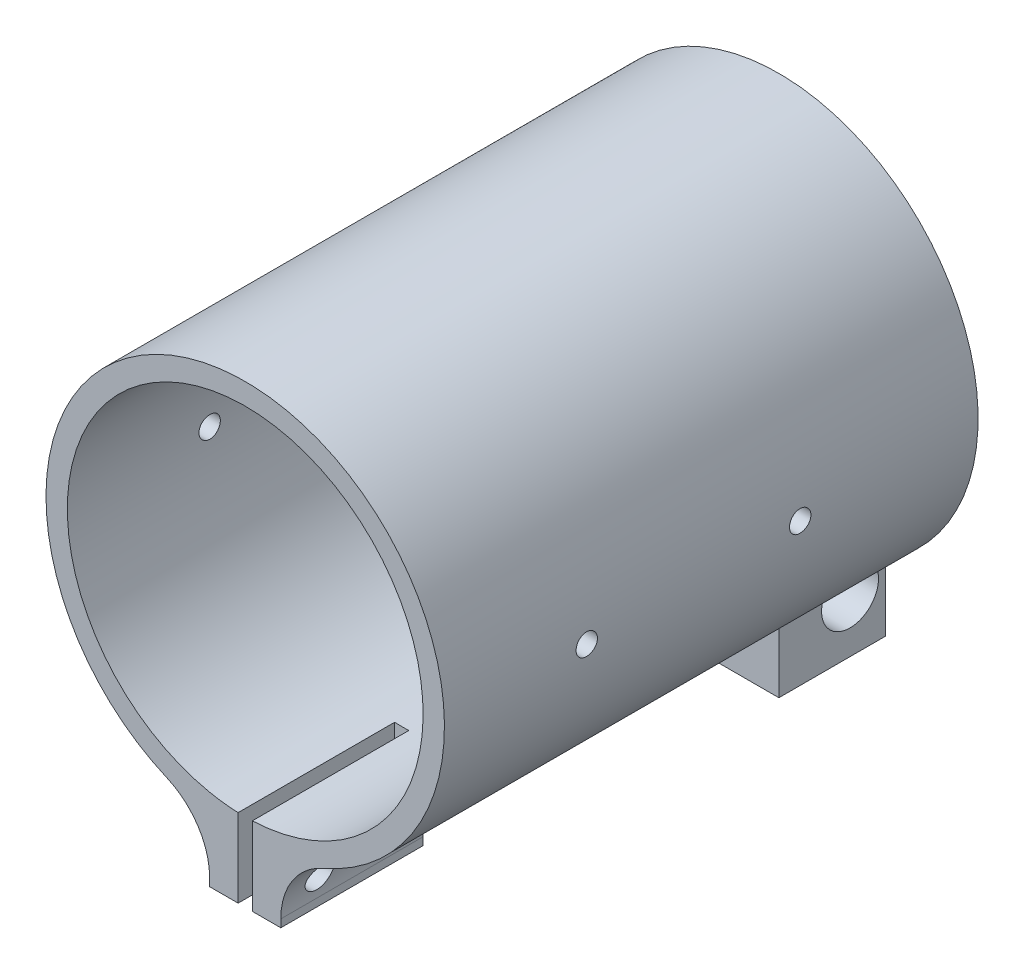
ISO-10303-21;
HEADER;
FILE_DESCRIPTION(('STEP AP214'),'2;1');
FILE_NAME('part.step','',(''),(''),'','','');
FILE_SCHEMA(('AUTOMOTIVE_DESIGN { 1 0 10303 214 1 1 1 1 }'));
ENDSEC;
DATA;
#1=APPLICATION_CONTEXT('core data for automotive mechanical design processes');
#2=APPLICATION_PROTOCOL_DEFINITION('international standard','automotive_design',2000,#1);
#3=PRODUCT_CONTEXT('',#1,'mechanical');
#4=PRODUCT('Part','Part','',(#3));
#5=PRODUCT_RELATED_PRODUCT_CATEGORY('part','',(#4));
#6=PRODUCT_DEFINITION_FORMATION('','',#4);
#7=PRODUCT_DEFINITION_CONTEXT('part definition',#1,'design');
#8=PRODUCT_DEFINITION('design','',#6,#7);
#9=PRODUCT_DEFINITION_SHAPE('','',#8);
#10=(LENGTH_UNIT() NAMED_UNIT(*) SI_UNIT(.MILLI.,.METRE.));
#11=(NAMED_UNIT(*) PLANE_ANGLE_UNIT() SI_UNIT($,.RADIAN.));
#12=(NAMED_UNIT(*) SI_UNIT($,.STERADIAN.) SOLID_ANGLE_UNIT());
#13=UNCERTAINTY_MEASURE_WITH_UNIT(LENGTH_MEASURE(1.E-05),#10,'distance_accuracy_value','');
#14=(GEOMETRIC_REPRESENTATION_CONTEXT(3) GLOBAL_UNCERTAINTY_ASSIGNED_CONTEXT((#13)) GLOBAL_UNIT_ASSIGNED_CONTEXT((#10,
#11,#12)) REPRESENTATION_CONTEXT('',''));
#15=CARTESIAN_POINT('',(0.,0.,0.));
#16=DIRECTION('',(0.,0.,1.));
#17=DIRECTION('',(1.,0.,0.));
#18=AXIS2_PLACEMENT_3D('',#15,#16,#17);
#19=CARTESIAN_POINT('',(0.,-36.,55.));
#20=DIRECTION('',(0.,-1.,0.));
#21=DIRECTION('',(0.,0.,-1.));
#22=AXIS2_PLACEMENT_3D('',#19,#20,#21);
#23=PLANE('',#22);
#24=DIRECTION('',(0.,0.,1.));
#25=VECTOR('',#24,1.);
#26=CARTESIAN_POINT('',(1.00000000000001,-36.,55.));
#27=LINE('',#26,#25);
#28=CARTESIAN_POINT('',(1.00000000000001,-36.,55.));
#29=VERTEX_POINT('',#28);
#30=CARTESIAN_POINT('',(1.00000000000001,-36.,75.));
#31=VERTEX_POINT('',#30);
#32=EDGE_CURVE('E933',#29,#31,#27,.T.);
#33=ORIENTED_EDGE('',*,*,#32,.F.);
#34=DIRECTION('',(1.,0.,0.));
#35=VECTOR('',#34,1.);
#36=CARTESIAN_POINT('',(0.,-36.,55.));
#37=LINE('',#36,#35);
#38=CARTESIAN_POINT('',(5.,-36.,55.));
#39=VERTEX_POINT('',#38);
#40=EDGE_CURVE('E498',#29,#39,#37,.T.);
#41=ORIENTED_EDGE('',*,*,#40,.T.);
#42=DIRECTION('',(0.,0.,1.));
#43=VECTOR('',#42,1.);
#44=CARTESIAN_POINT('',(5.,-36.,55.));
#45=LINE('',#44,#43);
#46=CARTESIAN_POINT('',(5.,-36.,75.));
#47=VERTEX_POINT('',#46);
#48=EDGE_CURVE('E503',#39,#47,#45,.T.);
#49=ORIENTED_EDGE('',*,*,#48,.T.);
#50=DIRECTION('',(1.,0.,0.));
#51=VECTOR('',#50,1.);
#52=CARTESIAN_POINT('',(0.,-36.,75.));
#53=LINE('',#52,#51);
#54=EDGE_CURVE('E485',#31,#47,#53,.T.);
#55=ORIENTED_EDGE('',*,*,#54,.F.);
#56=EDGE_LOOP('',(#33,#41,#49,#55));
#57=FACE_BOUND('',#56,.T.);
#58=ADVANCED_FACE('F45',(#57),#23,.T.);
#59=CARTESIAN_POINT('',(0.,0.,55.));
#60=DIRECTION('',(0.,0.,1.));
#61=DIRECTION('',(1.,0.,0.));
#62=AXIS2_PLACEMENT_3D('',#59,#60,#61);
#63=PLANE('',#62);
#64=ORIENTED_EDGE('',*,*,#40,.F.);
#65=DIRECTION('',(0.,1.,0.));
#66=VECTOR('',#65,1.);
#67=CARTESIAN_POINT('',(0.999999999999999,0.,55.));
#68=LINE('',#67,#66);
#69=CARTESIAN_POINT('',(1.00000000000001,-27.9821371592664,55.));
#70=VERTEX_POINT('',#69);
#71=EDGE_CURVE('E551',#29,#70,#68,.T.);
#72=ORIENTED_EDGE('',*,*,#71,.T.);
#73=CARTESIAN_POINT('',(0.,0.,55.));
#74=DIRECTION('',(0.,0.,1.));
#75=DIRECTION('',(1.,0.,0.));
#76=AXIS2_PLACEMENT_3D('',#73,#74,#75);
#77=CIRCLE('',#76,28.);
#78=CARTESIAN_POINT('',(11.0526315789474,-25.7262382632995,55.));
#79=VERTEX_POINT('',#78);
#80=EDGE_CURVE('E901',#70,#79,#77,.T.);
#81=ORIENTED_EDGE('',*,*,#80,.T.);
#82=CARTESIAN_POINT('',(15.,-34.9141805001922,55.));
#83=DIRECTION('',(0.,0.,1.));
#84=DIRECTION('',(1.,0.,0.));
#85=AXIS2_PLACEMENT_3D('',#82,#83,#84);
#86=CIRCLE('',#85,10.);
#87=CARTESIAN_POINT('',(5.,-34.9141805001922,55.));
#88=VERTEX_POINT('',#87);
#89=EDGE_CURVE('E545',#79,#88,#86,.T.);
#90=ORIENTED_EDGE('',*,*,#89,.T.);
#91=DIRECTION('',(0.,1.,0.));
#92=VECTOR('',#91,1.);
#93=CARTESIAN_POINT('',(5.,0.,55.));
#94=LINE('',#93,#92);
#95=EDGE_CURVE('E896',#39,#88,#94,.T.);
#96=ORIENTED_EDGE('',*,*,#95,.F.);
#97=EDGE_LOOP('',(#64,#72,#81,#90,#96));
#98=FACE_BOUND('',#97,.T.);
#99=ADVANCED_FACE('F370',(#98),#63,.F.);
#100=CARTESIAN_POINT('',(0.,0.,75.));
#101=DIRECTION('',(0.,0.,-1.));
#102=DIRECTION('',(-1.,0.,0.));
#103=AXIS2_PLACEMENT_3D('',#100,#101,#102);
#104=CYLINDRICAL_SURFACE('',#103,28.);
#105=CARTESIAN_POINT('',(-28.,0.,53.5));
#106=CARTESIAN_POINT('',(-27.9999994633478,0.0841908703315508,53.5000037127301));
#107=CARTESIAN_POINT('',(-27.9996162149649,0.168441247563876,53.5071119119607));
#108=CARTESIAN_POINT('',(-27.9981242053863,0.334617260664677,53.535366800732));
#109=CARTESIAN_POINT('',(-27.9970145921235,0.416540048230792,53.556529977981));
#110=CARTESIAN_POINT('',(-27.9941954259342,0.57562965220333,53.6122866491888));
#111=CARTESIAN_POINT('',(-27.9924861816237,0.652798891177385,53.6468732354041));
#112=CARTESIAN_POINT('',(-27.9886601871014,0.800215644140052,53.7284841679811));
#113=CARTESIAN_POINT('',(-27.9865435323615,0.870464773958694,53.7755056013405));
#114=CARTESIAN_POINT('',(-27.9821380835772,1.00214789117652,53.8807107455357));
#115=CARTESIAN_POINT('',(-27.9798491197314,1.06357300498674,53.9389055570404));
#116=CARTESIAN_POINT('',(-27.9753584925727,1.1757887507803,54.0647831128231));
#117=CARTESIAN_POINT('',(-27.9731568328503,1.22657894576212,54.1324662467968));
#118=CARTESIAN_POINT('',(-27.9690878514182,1.31610854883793,54.2754469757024));
#119=CARTESIAN_POINT('',(-27.9672207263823,1.35484087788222,54.3507490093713));
#120=CARTESIAN_POINT('',(-27.9640334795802,1.41910990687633,54.5067987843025));
#121=CARTESIAN_POINT('',(-27.9627133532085,1.44464671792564,54.5875464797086));
#122=CARTESIAN_POINT('',(-27.9607705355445,1.4817759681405,54.7521124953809));
#123=CARTESIAN_POINT('',(-27.9601471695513,1.49338189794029,54.8359277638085));
#124=CARTESIAN_POINT('',(-27.9596661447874,1.50236156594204,55.0043189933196));
#125=CARTESIAN_POINT('',(-27.9598084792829,1.49973542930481,55.088894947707));
#126=CARTESIAN_POINT('',(-27.9608421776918,1.48033673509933,55.2563149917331));
#127=CARTESIAN_POINT('',(-27.9617327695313,1.46357875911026,55.3391607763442));
#128=CARTESIAN_POINT('',(-27.9641613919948,1.41641468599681,55.5008616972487));
#129=CARTESIAN_POINT('',(-27.9656994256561,1.38600852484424,55.5797168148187));
#130=CARTESIAN_POINT('',(-27.9692504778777,1.31239457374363,55.731244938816));
#131=CARTESIAN_POINT('',(-27.9712637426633,1.26918014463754,55.803914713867));
#132=CARTESIAN_POINT('',(-27.9755381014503,1.1711811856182,55.9409739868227));
#133=CARTESIAN_POINT('',(-27.9777991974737,1.11639656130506,56.0053634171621));
#134=CARTESIAN_POINT('',(-27.9823178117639,0.996730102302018,56.1241190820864));
#135=CARTESIAN_POINT('',(-27.9845753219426,0.931835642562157,56.1784725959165));
#136=CARTESIAN_POINT('',(-27.9888295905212,0.793835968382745,56.2755154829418));
#137=CARTESIAN_POINT('',(-27.9908263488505,0.720730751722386,56.3182048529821));
#138=CARTESIAN_POINT('',(-27.9943341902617,0.568377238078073,56.3907064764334));
#139=CARTESIAN_POINT('',(-27.995845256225,0.489128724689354,56.4205182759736));
#140=CARTESIAN_POINT('',(-27.9982111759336,0.326741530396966,56.466410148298));
#141=CARTESIAN_POINT('',(-27.9990660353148,0.243602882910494,56.4824903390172));
#142=CARTESIAN_POINT('',(-28.0000224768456,0.0759058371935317,56.500446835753));
#143=CARTESIAN_POINT('',(-28.0001249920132,-0.00865067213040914,56.5023407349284));
#144=CARTESIAN_POINT('',(-27.9995676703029,-0.17688025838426,56.4919168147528));
#145=CARTESIAN_POINT('',(-27.9989078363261,-0.260553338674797,56.4795990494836));
#146=CARTESIAN_POINT('',(-27.9969007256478,-0.424591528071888,56.4411160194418));
#147=CARTESIAN_POINT('',(-27.9955538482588,-0.504958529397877,56.4149587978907));
#148=CARTESIAN_POINT('',(-27.9923242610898,-0.660161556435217,56.3495475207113));
#149=CARTESIAN_POINT('',(-27.9904415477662,-0.734997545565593,56.3102933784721));
#150=CARTESIAN_POINT('',(-27.9863496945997,-0.87709495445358,56.2197575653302));
#151=CARTESIAN_POINT('',(-27.9841402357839,-0.944348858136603,56.1684641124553));
#152=CARTESIAN_POINT('',(-27.9796447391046,-1.06929740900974,56.0553229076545));
#153=CARTESIAN_POINT('',(-27.9773587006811,-1.12699198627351,55.9934750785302));
#154=CARTESIAN_POINT('',(-27.9729650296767,-1.23124347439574,55.8609050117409));
#155=CARTESIAN_POINT('',(-27.9708575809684,-1.27778899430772,55.7901738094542));
#156=CARTESIAN_POINT('',(-27.967061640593,-1.35834324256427,55.6418900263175));
#157=CARTESIAN_POINT('',(-27.9653731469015,-1.39235203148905,55.5643374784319));
#158=CARTESIAN_POINT('',(-27.9626068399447,-1.44684760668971,55.404654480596));
#159=CARTESIAN_POINT('',(-27.9615286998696,-1.4673416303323,55.322526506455));
#160=CARTESIAN_POINT('',(-27.9601037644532,-1.4942495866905,55.1559893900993));
#161=CARTESIAN_POINT('',(-27.9597569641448,-1.50066361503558,55.0715802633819));
#162=CARTESIAN_POINT('',(-27.9598339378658,-1.4992286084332,54.9029902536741));
#163=CARTESIAN_POINT('',(-27.960256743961,-1.4913974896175,54.8188092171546));
#164=CARTESIAN_POINT('',(-27.9618232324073,-1.46173155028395,54.6529589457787));
#165=CARTESIAN_POINT('',(-27.9629669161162,-1.43989670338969,54.5712897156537));
#166=CARTESIAN_POINT('',(-27.9658460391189,-1.38284689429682,54.412777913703));
#167=CARTESIAN_POINT('',(-27.9675814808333,-1.34763187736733,54.3359353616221));
#168=CARTESIAN_POINT('',(-27.9714484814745,-1.26482422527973,54.1892517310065));
#169=CARTESIAN_POINT('',(-27.9735800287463,-1.21723195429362,54.1194104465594));
#170=CARTESIAN_POINT('',(-27.9780020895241,-1.11095584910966,53.9886219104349));
#171=CARTESIAN_POINT('',(-27.9802927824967,-1.05225936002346,53.9276849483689));
#172=CARTESIAN_POINT('',(-27.9847736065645,-0.925452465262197,53.816510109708));
#173=CARTESIAN_POINT('',(-27.9869637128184,-0.857339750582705,53.766274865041));
#174=CARTESIAN_POINT('',(-27.9909982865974,-0.713574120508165,53.6779024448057));
#175=CARTESIAN_POINT('',(-27.9928423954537,-0.63791350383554,53.6397777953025));
#176=CARTESIAN_POINT('',(-27.9959719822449,-0.481311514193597,53.5768186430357));
#177=CARTESIAN_POINT('',(-27.9972581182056,-0.400376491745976,53.5519684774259));
#178=CARTESIAN_POINT('',(-27.998787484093,-0.265783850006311,53.5227663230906));
#179=CARTESIAN_POINT('',(-27.9992401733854,-0.212997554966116,53.5142398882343));
#180=CARTESIAN_POINT('',(-27.9998466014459,-0.106815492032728,53.5028555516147));
#181=CARTESIAN_POINT('',(-28.0000003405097,-0.0534197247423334,53.4999976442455));
#182=CARTESIAN_POINT('',(-28.,0.,53.5));
#183=B_SPLINE_CURVE_WITH_KNOTS('',3,(#105,#106,#107,#108,#109,#110,#111,#112,#113,#114,#115,
#116,#117,#118,#119,#120,#121,#122,#123,#124,#125,#126,#127,#128,#129,#130,#131,#132,#133,#134,
#135,#136,#137,#138,#139,#140,#141,#142,#143,#144,#145,#146,#147,#148,#149,#150,#151,#152,#153,
#154,#155,#156,#157,#158,#159,#160,#161,#162,#163,#164,#165,#166,#167,#168,#169,#170,#171,#172,
#173,#174,#175,#176,#177,#178,#179,#180,#181,#182),.UNSPECIFIED.,.T.,.F.,(4,2,2,2,2,2,2,2,2,2,2,
2,2,2,2,2,2,2,2,2,2,2,2,2,2,2,2,2,2,2,2,2,2,2,2,2,2,2,4),(0.,0.252377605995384,
0.505051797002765,0.757596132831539,1.01008135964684,1.26281873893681,1.51556650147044,
1.76846237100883,2.02135611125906,2.27400475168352,2.52665117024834,2.77903722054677,
3.0314244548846,3.28394274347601,3.53646309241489,3.78930135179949,4.04213967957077,
4.29498691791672,4.54783198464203,4.8003634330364,5.05289392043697,5.30527780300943,
5.55766335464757,5.81029693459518,6.06293236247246,6.31582481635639,6.5687160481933,
6.82147174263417,7.07422572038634,7.32666202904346,7.57909881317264,7.8315366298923,
8.08396702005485,8.33668684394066,8.58946874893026,8.84251126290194,9.09525454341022,
9.25539014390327,9.41552558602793),.UNSPECIFIED.);
#184=CARTESIAN_POINT('',(-28.,0.,53.5));
#185=VERTEX_POINT('',#184);
#186=EDGE_CURVE('E355',#185,#185,#183,.T.);
#187=ORIENTED_EDGE('',*,*,#186,.T.);
#188=EDGE_LOOP('',(#187));
#189=FACE_BOUND('',#188,.T.);
#190=CARTESIAN_POINT('',(28.,0.,53.5));
#191=CARTESIAN_POINT('',(27.9999994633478,-0.0841908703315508,53.5000037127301));
#192=CARTESIAN_POINT('',(27.9996162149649,-0.168441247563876,53.5071119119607));
#193=CARTESIAN_POINT('',(27.9981242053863,-0.334617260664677,53.535366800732));
#194=CARTESIAN_POINT('',(27.9970145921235,-0.416540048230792,53.556529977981));
#195=CARTESIAN_POINT('',(27.9941954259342,-0.57562965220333,53.6122866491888));
#196=CARTESIAN_POINT('',(27.9924861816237,-0.652798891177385,53.6468732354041));
#197=CARTESIAN_POINT('',(27.9886601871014,-0.800215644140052,53.7284841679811));
#198=CARTESIAN_POINT('',(27.9865435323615,-0.870464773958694,53.7755056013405));
#199=CARTESIAN_POINT('',(27.9821380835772,-1.00214789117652,53.8807107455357));
#200=CARTESIAN_POINT('',(27.9798491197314,-1.06357300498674,53.9389055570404));
#201=CARTESIAN_POINT('',(27.9753584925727,-1.1757887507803,54.0647831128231));
#202=CARTESIAN_POINT('',(27.9731568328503,-1.22657894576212,54.1324662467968));
#203=CARTESIAN_POINT('',(27.9690878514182,-1.31610854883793,54.2754469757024));
#204=CARTESIAN_POINT('',(27.9672207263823,-1.35484087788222,54.3507490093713));
#205=CARTESIAN_POINT('',(27.9640334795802,-1.41910990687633,54.5067987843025));
#206=CARTESIAN_POINT('',(27.9627133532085,-1.44464671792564,54.5875464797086));
#207=CARTESIAN_POINT('',(27.9607705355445,-1.4817759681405,54.7521124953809));
#208=CARTESIAN_POINT('',(27.9601471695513,-1.49338189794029,54.8359277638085));
#209=CARTESIAN_POINT('',(27.9596661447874,-1.50236156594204,55.0043189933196));
#210=CARTESIAN_POINT('',(27.9598084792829,-1.49973542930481,55.088894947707));
#211=CARTESIAN_POINT('',(27.9608421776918,-1.48033673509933,55.2563149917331));
#212=CARTESIAN_POINT('',(27.9617327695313,-1.46357875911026,55.3391607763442));
#213=CARTESIAN_POINT('',(27.9641613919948,-1.41641468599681,55.5008616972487));
#214=CARTESIAN_POINT('',(27.9656994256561,-1.38600852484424,55.5797168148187));
#215=CARTESIAN_POINT('',(27.9692504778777,-1.31239457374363,55.731244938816));
#216=CARTESIAN_POINT('',(27.9712637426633,-1.26918014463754,55.803914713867));
#217=CARTESIAN_POINT('',(27.9755381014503,-1.1711811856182,55.9409739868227));
#218=CARTESIAN_POINT('',(27.9777991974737,-1.11639656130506,56.0053634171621));
#219=CARTESIAN_POINT('',(27.9823178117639,-0.996730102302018,56.1241190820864));
#220=CARTESIAN_POINT('',(27.9845753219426,-0.931835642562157,56.1784725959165));
#221=CARTESIAN_POINT('',(27.9888295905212,-0.793835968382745,56.2755154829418));
#222=CARTESIAN_POINT('',(27.9908263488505,-0.720730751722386,56.3182048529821));
#223=CARTESIAN_POINT('',(27.9943341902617,-0.568377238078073,56.3907064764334));
#224=CARTESIAN_POINT('',(27.995845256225,-0.489128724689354,56.4205182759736));
#225=CARTESIAN_POINT('',(27.9982111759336,-0.326741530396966,56.466410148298));
#226=CARTESIAN_POINT('',(27.9990660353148,-0.243602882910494,56.4824903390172));
#227=CARTESIAN_POINT('',(28.0000224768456,-0.0759058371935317,56.500446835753));
#228=CARTESIAN_POINT('',(28.0001249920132,0.00865067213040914,56.5023407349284));
#229=CARTESIAN_POINT('',(27.9995676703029,0.17688025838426,56.4919168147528));
#230=CARTESIAN_POINT('',(27.9989078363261,0.260553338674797,56.4795990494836));
#231=CARTESIAN_POINT('',(27.9969007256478,0.424591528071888,56.4411160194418));
#232=CARTESIAN_POINT('',(27.9955538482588,0.504958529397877,56.4149587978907));
#233=CARTESIAN_POINT('',(27.9923242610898,0.660161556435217,56.3495475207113));
#234=CARTESIAN_POINT('',(27.9904415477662,0.734997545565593,56.3102933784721));
#235=CARTESIAN_POINT('',(27.9863496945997,0.87709495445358,56.2197575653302));
#236=CARTESIAN_POINT('',(27.9841402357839,0.944348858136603,56.1684641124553));
#237=CARTESIAN_POINT('',(27.9796447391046,1.06929740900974,56.0553229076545));
#238=CARTESIAN_POINT('',(27.9773587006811,1.12699198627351,55.9934750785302));
#239=CARTESIAN_POINT('',(27.9729650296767,1.23124347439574,55.8609050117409));
#240=CARTESIAN_POINT('',(27.9708575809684,1.27778899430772,55.7901738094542));
#241=CARTESIAN_POINT('',(27.967061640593,1.35834324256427,55.6418900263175));
#242=CARTESIAN_POINT('',(27.9653731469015,1.39235203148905,55.5643374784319));
#243=CARTESIAN_POINT('',(27.9626068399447,1.44684760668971,55.404654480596));
#244=CARTESIAN_POINT('',(27.9615286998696,1.4673416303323,55.322526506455));
#245=CARTESIAN_POINT('',(27.9601037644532,1.4942495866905,55.1559893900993));
#246=CARTESIAN_POINT('',(27.9597569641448,1.50066361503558,55.0715802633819));
#247=CARTESIAN_POINT('',(27.9598339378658,1.4992286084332,54.9029902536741));
#248=CARTESIAN_POINT('',(27.960256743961,1.4913974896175,54.8188092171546));
#249=CARTESIAN_POINT('',(27.9618232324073,1.46173155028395,54.6529589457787));
#250=CARTESIAN_POINT('',(27.9629669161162,1.43989670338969,54.5712897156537));
#251=CARTESIAN_POINT('',(27.9658460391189,1.38284689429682,54.412777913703));
#252=CARTESIAN_POINT('',(27.9675814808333,1.34763187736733,54.3359353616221));
#253=CARTESIAN_POINT('',(27.9714484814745,1.26482422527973,54.1892517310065));
#254=CARTESIAN_POINT('',(27.9735800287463,1.21723195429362,54.1194104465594));
#255=CARTESIAN_POINT('',(27.9780020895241,1.11095584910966,53.9886219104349));
#256=CARTESIAN_POINT('',(27.9802927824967,1.05225936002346,53.9276849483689));
#257=CARTESIAN_POINT('',(27.9847736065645,0.925452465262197,53.816510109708));
#258=CARTESIAN_POINT('',(27.9869637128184,0.857339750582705,53.766274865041));
#259=CARTESIAN_POINT('',(27.9909982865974,0.713574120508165,53.6779024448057));
#260=CARTESIAN_POINT('',(27.9928423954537,0.63791350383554,53.6397777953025));
#261=CARTESIAN_POINT('',(27.9959719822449,0.481311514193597,53.5768186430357));
#262=CARTESIAN_POINT('',(27.9972581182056,0.400376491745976,53.5519684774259));
#263=CARTESIAN_POINT('',(27.998787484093,0.265783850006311,53.5227663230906));
#264=CARTESIAN_POINT('',(27.9992401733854,0.212997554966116,53.5142398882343));
#265=CARTESIAN_POINT('',(27.9998466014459,0.106815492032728,53.5028555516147));
#266=CARTESIAN_POINT('',(28.0000003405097,0.0534197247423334,53.4999976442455));
#267=CARTESIAN_POINT('',(28.,0.,53.5));
#268=B_SPLINE_CURVE_WITH_KNOTS('',3,(#190,#191,#192,#193,#194,#195,#196,#197,#198,#199,#200,
#201,#202,#203,#204,#205,#206,#207,#208,#209,#210,#211,#212,#213,#214,#215,#216,#217,#218,#219,
#220,#221,#222,#223,#224,#225,#226,#227,#228,#229,#230,#231,#232,#233,#234,#235,#236,#237,#238,
#239,#240,#241,#242,#243,#244,#245,#246,#247,#248,#249,#250,#251,#252,#253,#254,#255,#256,#257,
#258,#259,#260,#261,#262,#263,#264,#265,#266,#267),.UNSPECIFIED.,.T.,.F.,(4,2,2,2,2,2,2,2,2,2,2,
2,2,2,2,2,2,2,2,2,2,2,2,2,2,2,2,2,2,2,2,2,2,2,2,2,2,2,4),(0.,0.252377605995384,
0.505051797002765,0.757596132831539,1.01008135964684,1.26281873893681,1.51556650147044,
1.76846237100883,2.02135611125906,2.27400475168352,2.52665117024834,2.77903722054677,
3.0314244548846,3.28394274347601,3.53646309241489,3.78930135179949,4.04213967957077,
4.29498691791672,4.54783198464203,4.8003634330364,5.05289392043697,5.30527780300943,
5.55766335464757,5.81029693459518,6.06293236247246,6.31582481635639,6.5687160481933,
6.82147174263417,7.07422572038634,7.32666202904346,7.57909881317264,7.8315366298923,
8.08396702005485,8.33668684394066,8.58946874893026,8.84251126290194,9.09525454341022,
9.25539014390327,9.41552558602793),.UNSPECIFIED.);
#269=CARTESIAN_POINT('',(28.,0.,53.5));
#270=VERTEX_POINT('',#269);
#271=EDGE_CURVE('E347',#270,#270,#268,.T.);
#272=ORIENTED_EDGE('',*,*,#271,.T.);
#273=EDGE_LOOP('',(#272));
#274=FACE_BOUND('',#273,.T.);
#275=CARTESIAN_POINT('',(-28.,0.,23.5));
#276=CARTESIAN_POINT('',(-27.9999994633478,0.0841908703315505,23.5000037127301));
#277=CARTESIAN_POINT('',(-27.9996162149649,0.168441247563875,23.5071119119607));
#278=CARTESIAN_POINT('',(-27.9981242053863,0.334617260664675,23.535366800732));
#279=CARTESIAN_POINT('',(-27.9970145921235,0.41654004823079,23.556529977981));
#280=CARTESIAN_POINT('',(-27.9941954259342,0.575629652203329,23.6122866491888));
#281=CARTESIAN_POINT('',(-27.9924861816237,0.652798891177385,23.6468732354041));
#282=CARTESIAN_POINT('',(-27.9886601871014,0.800215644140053,23.7284841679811));
#283=CARTESIAN_POINT('',(-27.9865435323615,0.870464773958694,23.7755056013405));
#284=CARTESIAN_POINT('',(-27.9821380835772,1.00214789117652,23.8807107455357));
#285=CARTESIAN_POINT('',(-27.9798491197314,1.06357300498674,23.9389055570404));
#286=CARTESIAN_POINT('',(-27.9753584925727,1.1757887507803,24.0647831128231));
#287=CARTESIAN_POINT('',(-27.9731568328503,1.22657894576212,24.1324662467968));
#288=CARTESIAN_POINT('',(-27.9690878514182,1.31610854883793,24.2754469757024));
#289=CARTESIAN_POINT('',(-27.9672207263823,1.35484087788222,24.3507490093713));
#290=CARTESIAN_POINT('',(-27.9640334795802,1.41910990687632,24.5067987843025));
#291=CARTESIAN_POINT('',(-27.9627133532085,1.44464671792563,24.5875464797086));
#292=CARTESIAN_POINT('',(-27.9607705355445,1.4817759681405,24.7521124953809));
#293=CARTESIAN_POINT('',(-27.9601471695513,1.49338189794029,24.8359277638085));
#294=CARTESIAN_POINT('',(-27.9596661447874,1.50236156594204,25.0043189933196));
#295=CARTESIAN_POINT('',(-27.9598084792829,1.49973542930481,25.088894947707));
#296=CARTESIAN_POINT('',(-27.9608421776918,1.48033673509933,25.2563149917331));
#297=CARTESIAN_POINT('',(-27.9617327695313,1.46357875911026,25.3391607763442));
#298=CARTESIAN_POINT('',(-27.9641613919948,1.4164146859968,25.5008616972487));
#299=CARTESIAN_POINT('',(-27.9656994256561,1.38600852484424,25.5797168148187));
#300=CARTESIAN_POINT('',(-27.9692504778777,1.31239457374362,25.731244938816));
#301=CARTESIAN_POINT('',(-27.9712637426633,1.26918014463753,25.803914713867));
#302=CARTESIAN_POINT('',(-27.9755381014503,1.1711811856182,25.9409739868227));
#303=CARTESIAN_POINT('',(-27.9777991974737,1.11639656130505,26.0053634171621));
#304=CARTESIAN_POINT('',(-27.9823178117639,0.99673010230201,26.1241190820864));
#305=CARTESIAN_POINT('',(-27.9845753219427,0.931835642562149,26.1784725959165));
#306=CARTESIAN_POINT('',(-27.9888295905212,0.793835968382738,26.2755154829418));
#307=CARTESIAN_POINT('',(-27.9908263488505,0.720730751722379,26.3182048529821));
#308=CARTESIAN_POINT('',(-27.9943341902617,0.568377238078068,26.3907064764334));
#309=CARTESIAN_POINT('',(-27.995845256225,0.489128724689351,26.4205182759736));
#310=CARTESIAN_POINT('',(-27.9982111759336,0.326741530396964,26.466410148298));
#311=CARTESIAN_POINT('',(-27.9990660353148,0.243602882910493,26.4824903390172));
#312=CARTESIAN_POINT('',(-28.0000224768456,0.0759058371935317,26.500446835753));
#313=CARTESIAN_POINT('',(-28.0001249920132,-0.00865067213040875,26.5023407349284));
#314=CARTESIAN_POINT('',(-27.9995676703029,-0.17688025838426,26.4919168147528));
#315=CARTESIAN_POINT('',(-27.9989078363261,-0.260553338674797,26.4795990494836));
#316=CARTESIAN_POINT('',(-27.9969007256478,-0.424591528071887,26.4411160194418));
#317=CARTESIAN_POINT('',(-27.9955538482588,-0.504958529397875,26.4149587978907));
#318=CARTESIAN_POINT('',(-27.9923242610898,-0.660161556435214,26.3495475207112));
#319=CARTESIAN_POINT('',(-27.9904415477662,-0.734997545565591,26.3102933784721));
#320=CARTESIAN_POINT('',(-27.9863496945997,-0.877094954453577,26.2197575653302));
#321=CARTESIAN_POINT('',(-27.9841402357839,-0.944348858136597,26.1684641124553));
#322=CARTESIAN_POINT('',(-27.9796447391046,-1.06929740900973,26.0553229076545));
#323=CARTESIAN_POINT('',(-27.9773587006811,-1.1269919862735,25.9934750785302));
#324=CARTESIAN_POINT('',(-27.9729650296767,-1.23124347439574,25.8609050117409));
#325=CARTESIAN_POINT('',(-27.9708575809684,-1.27778899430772,25.7901738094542));
#326=CARTESIAN_POINT('',(-27.967061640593,-1.35834324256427,25.6418900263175));
#327=CARTESIAN_POINT('',(-27.9653731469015,-1.39235203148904,25.5643374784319));
#328=CARTESIAN_POINT('',(-27.9626068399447,-1.44684760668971,25.404654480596));
#329=CARTESIAN_POINT('',(-27.9615286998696,-1.4673416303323,25.322526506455));
#330=CARTESIAN_POINT('',(-27.9601037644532,-1.4942495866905,25.1559893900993));
#331=CARTESIAN_POINT('',(-27.9597569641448,-1.50066361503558,25.0715802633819));
#332=CARTESIAN_POINT('',(-27.9598339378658,-1.4992286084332,24.9029902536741));
#333=CARTESIAN_POINT('',(-27.960256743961,-1.4913974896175,24.8188092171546));
#334=CARTESIAN_POINT('',(-27.9618232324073,-1.46173155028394,24.6529589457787));
#335=CARTESIAN_POINT('',(-27.9629669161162,-1.43989670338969,24.5712897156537));
#336=CARTESIAN_POINT('',(-27.9658460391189,-1.38284689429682,24.412777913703));
#337=CARTESIAN_POINT('',(-27.9675814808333,-1.34763187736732,24.3359353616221));
#338=CARTESIAN_POINT('',(-27.9714484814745,-1.26482422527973,24.1892517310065));
#339=CARTESIAN_POINT('',(-27.9735800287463,-1.21723195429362,24.1194104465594));
#340=CARTESIAN_POINT('',(-27.9780020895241,-1.11095584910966,23.9886219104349));
#341=CARTESIAN_POINT('',(-27.9802927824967,-1.05225936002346,23.9276849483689));
#342=CARTESIAN_POINT('',(-27.9847736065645,-0.925452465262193,23.816510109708));
#343=CARTESIAN_POINT('',(-27.9869637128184,-0.8573397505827,23.766274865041));
#344=CARTESIAN_POINT('',(-27.9909982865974,-0.713574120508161,23.6779024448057));
#345=CARTESIAN_POINT('',(-27.9928423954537,-0.637913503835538,23.6397777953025));
#346=CARTESIAN_POINT('',(-27.9959719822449,-0.481311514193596,23.5768186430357));
#347=CARTESIAN_POINT('',(-27.9972581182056,-0.400376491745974,23.5519684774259));
#348=CARTESIAN_POINT('',(-27.998787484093,-0.265783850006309,23.5227663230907));
#349=CARTESIAN_POINT('',(-27.9992401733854,-0.212997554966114,23.5142398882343));
#350=CARTESIAN_POINT('',(-27.9998466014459,-0.106815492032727,23.5028555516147));
#351=CARTESIAN_POINT('',(-28.0000003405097,-0.0534197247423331,23.4999976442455));
#352=CARTESIAN_POINT('',(-28.,0.,23.5));
#353=B_SPLINE_CURVE_WITH_KNOTS('',3,(#275,#276,#277,#278,#279,#280,#281,#282,#283,#284,#285,
#286,#287,#288,#289,#290,#291,#292,#293,#294,#295,#296,#297,#298,#299,#300,#301,#302,#303,#304,
#305,#306,#307,#308,#309,#310,#311,#312,#313,#314,#315,#316,#317,#318,#319,#320,#321,#322,#323,
#324,#325,#326,#327,#328,#329,#330,#331,#332,#333,#334,#335,#336,#337,#338,#339,#340,#341,#342,
#343,#344,#345,#346,#347,#348,#349,#350,#351,#352),.UNSPECIFIED.,.T.,.F.,(4,2,2,2,2,2,2,2,2,2,2,
2,2,2,2,2,2,2,2,2,2,2,2,2,2,2,2,2,2,2,2,2,2,2,2,2,2,2,4),(0.,0.252377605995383,
0.505051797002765,0.757596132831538,1.01008135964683,1.26281873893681,1.51556650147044,
1.76846237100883,2.02135611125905,2.27400475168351,2.52665117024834,2.77903722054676,
3.0314244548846,3.28394274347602,3.53646309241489,3.78930135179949,4.04213967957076,
4.29498691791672,4.54783198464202,4.80036343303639,5.05289392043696,5.30527780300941,
5.55766335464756,5.81029693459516,6.06293236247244,6.31582481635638,6.56871604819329,
6.82147174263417,7.07422572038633,7.32666202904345,7.57909881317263,7.83153662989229,
8.08396702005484,8.33668684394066,8.58946874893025,8.84251126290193,9.09525454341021,
9.25539014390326,9.41552558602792),.UNSPECIFIED.);
#354=CARTESIAN_POINT('',(-28.,0.,23.5));
#355=VERTEX_POINT('',#354);
#356=EDGE_CURVE('E356',#355,#355,#353,.T.);
#357=ORIENTED_EDGE('',*,*,#356,.T.);
#358=EDGE_LOOP('',(#357));
#359=FACE_BOUND('',#358,.T.);
#360=CARTESIAN_POINT('',(28.,0.,23.5));
#361=CARTESIAN_POINT('',(27.9999994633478,-0.0841908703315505,23.5000037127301));
#362=CARTESIAN_POINT('',(27.9996162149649,-0.168441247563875,23.5071119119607));
#363=CARTESIAN_POINT('',(27.9981242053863,-0.334617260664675,23.535366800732));
#364=CARTESIAN_POINT('',(27.9970145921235,-0.41654004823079,23.556529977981));
#365=CARTESIAN_POINT('',(27.9941954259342,-0.575629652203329,23.6122866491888));
#366=CARTESIAN_POINT('',(27.9924861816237,-0.652798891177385,23.6468732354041));
#367=CARTESIAN_POINT('',(27.9886601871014,-0.800215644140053,23.7284841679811));
#368=CARTESIAN_POINT('',(27.9865435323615,-0.870464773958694,23.7755056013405));
#369=CARTESIAN_POINT('',(27.9821380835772,-1.00214789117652,23.8807107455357));
#370=CARTESIAN_POINT('',(27.9798491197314,-1.06357300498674,23.9389055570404));
#371=CARTESIAN_POINT('',(27.9753584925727,-1.1757887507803,24.0647831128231));
#372=CARTESIAN_POINT('',(27.9731568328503,-1.22657894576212,24.1324662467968));
#373=CARTESIAN_POINT('',(27.9690878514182,-1.31610854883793,24.2754469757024));
#374=CARTESIAN_POINT('',(27.9672207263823,-1.35484087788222,24.3507490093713));
#375=CARTESIAN_POINT('',(27.9640334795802,-1.41910990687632,24.5067987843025));
#376=CARTESIAN_POINT('',(27.9627133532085,-1.44464671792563,24.5875464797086));
#377=CARTESIAN_POINT('',(27.9607705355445,-1.4817759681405,24.7521124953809));
#378=CARTESIAN_POINT('',(27.9601471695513,-1.49338189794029,24.8359277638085));
#379=CARTESIAN_POINT('',(27.9596661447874,-1.50236156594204,25.0043189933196));
#380=CARTESIAN_POINT('',(27.9598084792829,-1.49973542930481,25.088894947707));
#381=CARTESIAN_POINT('',(27.9608421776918,-1.48033673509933,25.2563149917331));
#382=CARTESIAN_POINT('',(27.9617327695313,-1.46357875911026,25.3391607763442));
#383=CARTESIAN_POINT('',(27.9641613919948,-1.4164146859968,25.5008616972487));
#384=CARTESIAN_POINT('',(27.9656994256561,-1.38600852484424,25.5797168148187));
#385=CARTESIAN_POINT('',(27.9692504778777,-1.31239457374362,25.731244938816));
#386=CARTESIAN_POINT('',(27.9712637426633,-1.26918014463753,25.803914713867));
#387=CARTESIAN_POINT('',(27.9755381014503,-1.1711811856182,25.9409739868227));
#388=CARTESIAN_POINT('',(27.9777991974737,-1.11639656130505,26.0053634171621));
#389=CARTESIAN_POINT('',(27.9823178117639,-0.99673010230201,26.1241190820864));
#390=CARTESIAN_POINT('',(27.9845753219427,-0.931835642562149,26.1784725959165));
#391=CARTESIAN_POINT('',(27.9888295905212,-0.793835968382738,26.2755154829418));
#392=CARTESIAN_POINT('',(27.9908263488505,-0.720730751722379,26.3182048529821));
#393=CARTESIAN_POINT('',(27.9943341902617,-0.568377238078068,26.3907064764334));
#394=CARTESIAN_POINT('',(27.995845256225,-0.489128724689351,26.4205182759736));
#395=CARTESIAN_POINT('',(27.9982111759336,-0.326741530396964,26.466410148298));
#396=CARTESIAN_POINT('',(27.9990660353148,-0.243602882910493,26.4824903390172));
#397=CARTESIAN_POINT('',(28.0000224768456,-0.0759058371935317,26.500446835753));
#398=CARTESIAN_POINT('',(28.0001249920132,0.00865067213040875,26.5023407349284));
#399=CARTESIAN_POINT('',(27.9995676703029,0.17688025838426,26.4919168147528));
#400=CARTESIAN_POINT('',(27.9989078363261,0.260553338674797,26.4795990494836));
#401=CARTESIAN_POINT('',(27.9969007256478,0.424591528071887,26.4411160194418));
#402=CARTESIAN_POINT('',(27.9955538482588,0.504958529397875,26.4149587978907));
#403=CARTESIAN_POINT('',(27.9923242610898,0.660161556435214,26.3495475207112));
#404=CARTESIAN_POINT('',(27.9904415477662,0.734997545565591,26.3102933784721));
#405=CARTESIAN_POINT('',(27.9863496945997,0.877094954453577,26.2197575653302));
#406=CARTESIAN_POINT('',(27.9841402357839,0.944348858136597,26.1684641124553));
#407=CARTESIAN_POINT('',(27.9796447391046,1.06929740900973,26.0553229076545));
#408=CARTESIAN_POINT('',(27.9773587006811,1.1269919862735,25.9934750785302));
#409=CARTESIAN_POINT('',(27.9729650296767,1.23124347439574,25.8609050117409));
#410=CARTESIAN_POINT('',(27.9708575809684,1.27778899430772,25.7901738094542));
#411=CARTESIAN_POINT('',(27.967061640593,1.35834324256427,25.6418900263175));
#412=CARTESIAN_POINT('',(27.9653731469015,1.39235203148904,25.5643374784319));
#413=CARTESIAN_POINT('',(27.9626068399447,1.44684760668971,25.404654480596));
#414=CARTESIAN_POINT('',(27.9615286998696,1.4673416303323,25.322526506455));
#415=CARTESIAN_POINT('',(27.9601037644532,1.4942495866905,25.1559893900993));
#416=CARTESIAN_POINT('',(27.9597569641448,1.50066361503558,25.0715802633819));
#417=CARTESIAN_POINT('',(27.9598339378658,1.4992286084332,24.9029902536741));
#418=CARTESIAN_POINT('',(27.960256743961,1.4913974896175,24.8188092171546));
#419=CARTESIAN_POINT('',(27.9618232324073,1.46173155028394,24.6529589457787));
#420=CARTESIAN_POINT('',(27.9629669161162,1.43989670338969,24.5712897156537));
#421=CARTESIAN_POINT('',(27.9658460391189,1.38284689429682,24.412777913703));
#422=CARTESIAN_POINT('',(27.9675814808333,1.34763187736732,24.3359353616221));
#423=CARTESIAN_POINT('',(27.9714484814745,1.26482422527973,24.1892517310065));
#424=CARTESIAN_POINT('',(27.9735800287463,1.21723195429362,24.1194104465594));
#425=CARTESIAN_POINT('',(27.9780020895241,1.11095584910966,23.9886219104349));
#426=CARTESIAN_POINT('',(27.9802927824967,1.05225936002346,23.9276849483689));
#427=CARTESIAN_POINT('',(27.9847736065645,0.925452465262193,23.816510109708));
#428=CARTESIAN_POINT('',(27.9869637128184,0.8573397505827,23.766274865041));
#429=CARTESIAN_POINT('',(27.9909982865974,0.713574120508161,23.6779024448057));
#430=CARTESIAN_POINT('',(27.9928423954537,0.637913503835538,23.6397777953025));
#431=CARTESIAN_POINT('',(27.9959719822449,0.481311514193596,23.5768186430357));
#432=CARTESIAN_POINT('',(27.9972581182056,0.400376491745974,23.5519684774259));
#433=CARTESIAN_POINT('',(27.998787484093,0.265783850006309,23.5227663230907));
#434=CARTESIAN_POINT('',(27.9992401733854,0.212997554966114,23.5142398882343));
#435=CARTESIAN_POINT('',(27.9998466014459,0.106815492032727,23.5028555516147));
#436=CARTESIAN_POINT('',(28.0000003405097,0.0534197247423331,23.4999976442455));
#437=CARTESIAN_POINT('',(28.,0.,23.5));
#438=B_SPLINE_CURVE_WITH_KNOTS('',3,(#360,#361,#362,#363,#364,#365,#366,#367,#368,#369,#370,
#371,#372,#373,#374,#375,#376,#377,#378,#379,#380,#381,#382,#383,#384,#385,#386,#387,#388,#389,
#390,#391,#392,#393,#394,#395,#396,#397,#398,#399,#400,#401,#402,#403,#404,#405,#406,#407,#408,
#409,#410,#411,#412,#413,#414,#415,#416,#417,#418,#419,#420,#421,#422,#423,#424,#425,#426,#427,
#428,#429,#430,#431,#432,#433,#434,#435,#436,#437),.UNSPECIFIED.,.T.,.F.,(4,2,2,2,2,2,2,2,2,2,2,
2,2,2,2,2,2,2,2,2,2,2,2,2,2,2,2,2,2,2,2,2,2,2,2,2,2,2,4),(0.,0.252377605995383,
0.505051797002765,0.757596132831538,1.01008135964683,1.26281873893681,1.51556650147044,
1.76846237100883,2.02135611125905,2.27400475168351,2.52665117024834,2.77903722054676,
3.0314244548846,3.28394274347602,3.53646309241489,3.78930135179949,4.04213967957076,
4.29498691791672,4.54783198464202,4.80036343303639,5.05289392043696,5.30527780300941,
5.55766335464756,5.81029693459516,6.06293236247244,6.31582481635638,6.56871604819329,
6.82147174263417,7.07422572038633,7.32666202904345,7.57909881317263,7.83153662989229,
8.08396702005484,8.33668684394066,8.58946874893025,8.84251126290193,9.09525454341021,
9.25539014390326,9.41552558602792),.UNSPECIFIED.);
#439=CARTESIAN_POINT('',(28.,0.,23.5));
#440=VERTEX_POINT('',#439);
#441=EDGE_CURVE('E378',#440,#440,#438,.T.);
#442=ORIENTED_EDGE('',*,*,#441,.T.);
#443=EDGE_LOOP('',(#442));
#444=FACE_BOUND('',#443,.T.);
#445=ORIENTED_EDGE('',*,*,#80,.F.);
#446=DIRECTION('',(0.,0.,-1.));
#447=VECTOR('',#446,1.);
#448=CARTESIAN_POINT('',(1.00000000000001,-27.9821371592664,75.));
#449=LINE('',#448,#447);
#450=CARTESIAN_POINT('',(1.00000000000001,-27.9821371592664,53.));
#451=VERTEX_POINT('',#450);
#452=EDGE_CURVE('E928',#70,#451,#449,.T.);
#453=ORIENTED_EDGE('',*,*,#452,.T.);
#454=CARTESIAN_POINT('',(0.,0.,53.));
#455=DIRECTION('',(0.,0.,1.));
#456=DIRECTION('',(1.,0.,0.));
#457=AXIS2_PLACEMENT_3D('',#454,#455,#456);
#458=CIRCLE('',#457,28.);
#459=CARTESIAN_POINT('',(-0.999999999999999,-27.9821371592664,53.));
#460=VERTEX_POINT('',#459);
#461=EDGE_CURVE('E491',#460,#451,#458,.T.);
#462=ORIENTED_EDGE('',*,*,#461,.F.);
#463=DIRECTION('',(0.,0.,-1.));
#464=VECTOR('',#463,1.);
#465=CARTESIAN_POINT('',(-0.999999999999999,-27.9821371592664,75.));
#466=LINE('',#465,#464);
#467=CARTESIAN_POINT('',(-0.999999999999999,-27.9821371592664,55.));
#468=VERTEX_POINT('',#467);
#469=EDGE_CURVE('E473',#460,#468,#466,.F.);
#470=ORIENTED_EDGE('',*,*,#469,.T.);
#471=CARTESIAN_POINT('',(-11.0526315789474,-25.7262382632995,55.));
#472=VERTEX_POINT('',#471);
#473=EDGE_CURVE('E912',#472,#468,#77,.T.);
#474=ORIENTED_EDGE('',*,*,#473,.F.);
#475=DIRECTION('',(0.,0.,-1.));
#476=VECTOR('',#475,1.);
#477=CARTESIAN_POINT('',(-11.0526315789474,-25.7262382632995,75.));
#478=LINE('',#477,#476);
#479=CARTESIAN_POINT('',(-11.0526315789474,-25.7262382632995,75.));
#480=VERTEX_POINT('',#479);
#481=EDGE_CURVE('E524',#472,#480,#478,.F.);
#482=ORIENTED_EDGE('',*,*,#481,.T.);
#483=CARTESIAN_POINT('',(0.,0.,75.));
#484=DIRECTION('',(0.,0.,1.));
#485=DIRECTION('',(1.,0.,0.));
#486=AXIS2_PLACEMENT_3D('',#483,#484,#485);
#487=CIRCLE('',#486,28.);
#488=CARTESIAN_POINT('',(11.0526315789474,-25.7262382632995,75.));
#489=VERTEX_POINT('',#488);
#490=EDGE_CURVE('E514',#489,#480,#487,.T.);
#491=ORIENTED_EDGE('',*,*,#490,.F.);
#492=DIRECTION('',(0.,0.,-1.));
#493=VECTOR('',#492,1.);
#494=CARTESIAN_POINT('',(11.0526315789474,-25.7262382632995,75.));
#495=LINE('',#494,#493);
#496=EDGE_CURVE('E518',#489,#79,#495,.T.);
#497=ORIENTED_EDGE('',*,*,#496,.T.);
#498=EDGE_LOOP('',(#445,#453,#462,#470,#474,#482,#491,#497));
#499=FACE_BOUND('',#498,.T.);
#500=CARTESIAN_POINT('',(0.,0.,4.99999999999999));
#501=DIRECTION('',(0.,0.,-1.));
#502=DIRECTION('',(0.,1.,0.));
#503=AXIS2_PLACEMENT_3D('',#500,#501,#502);
#504=CIRCLE('',#503,28.);
#505=CARTESIAN_POINT('',(5.,-27.5499546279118,4.99999999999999));
#506=VERTEX_POINT('',#505);
#507=CARTESIAN_POINT('',(-5.,-27.5499546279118,5.));
#508=VERTEX_POINT('',#507);
#509=EDGE_CURVE('E62',#506,#508,#504,.T.);
#510=ORIENTED_EDGE('',*,*,#509,.F.);
#511=DIRECTION('',(0.,0.,-1.));
#512=VECTOR('',#511,1.);
#513=CARTESIAN_POINT('',(5.,-27.5499546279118,75.));
#514=LINE('',#513,#512);
#515=CARTESIAN_POINT('',(5.,-27.5499546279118,0.));
#516=VERTEX_POINT('',#515);
#517=EDGE_CURVE('E284',#506,#516,#514,.T.);
#518=ORIENTED_EDGE('',*,*,#517,.T.);
#519=CARTESIAN_POINT('',(0.,0.,0.));
#520=DIRECTION('',(0.,0.,1.));
#521=DIRECTION('',(1.,0.,0.));
#522=AXIS2_PLACEMENT_3D('',#519,#520,#521);
#523=CIRCLE('',#522,28.);
#524=CARTESIAN_POINT('',(-5.,-27.5499546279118,0.));
#525=VERTEX_POINT('',#524);
#526=EDGE_CURVE('E510',#516,#525,#523,.T.);
#527=ORIENTED_EDGE('',*,*,#526,.T.);
#528=DIRECTION('',(0.,0.,-1.));
#529=VECTOR('',#528,1.);
#530=CARTESIAN_POINT('',(-5.,-27.5499546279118,75.));
#531=LINE('',#530,#529);
#532=EDGE_CURVE('E67',#508,#525,#531,.T.);
#533=ORIENTED_EDGE('',*,*,#532,.F.);
#534=EDGE_LOOP('',(#510,#518,#527,#533));
#535=FACE_BOUND('',#534,.T.);
#536=ADVANCED_FACE('F365',(#189,#274,#359,#444,#499,#535),#104,.T.);
#537=CARTESIAN_POINT('',(0.,0.,75.));
#538=DIRECTION('',(0.,0.,1.));
#539=DIRECTION('',(1.,0.,0.));
#540=AXIS2_PLACEMENT_3D('',#537,#538,#539);
#541=PLANE('',#540);
#542=DIRECTION('',(0.,1.,0.));
#543=VECTOR('',#542,1.);
#544=CARTESIAN_POINT('',(1.,-6.07639345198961,75.));
#545=LINE('',#544,#543);
#546=CARTESIAN_POINT('',(1.00000000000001,-24.9799919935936,75.));
#547=VERTEX_POINT('',#546);
#548=EDGE_CURVE('E947',#31,#547,#545,.T.);
#549=ORIENTED_EDGE('',*,*,#548,.F.);
#550=ORIENTED_EDGE('',*,*,#54,.T.);
#551=DIRECTION('',(0.,1.,0.));
#552=VECTOR('',#551,1.);
#553=CARTESIAN_POINT('',(5.,0.,75.));
#554=LINE('',#553,#552);
#555=CARTESIAN_POINT('',(5.,-34.9141805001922,75.));
#556=VERTEX_POINT('',#555);
#557=EDGE_CURVE('E484',#47,#556,#554,.T.);
#558=ORIENTED_EDGE('',*,*,#557,.T.);
#559=CARTESIAN_POINT('',(15.,-34.9141805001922,75.));
#560=DIRECTION('',(0.,0.,1.));
#561=DIRECTION('',(1.,0.,0.));
#562=AXIS2_PLACEMENT_3D('',#559,#560,#561);
#563=CIRCLE('',#562,10.);
#564=EDGE_CURVE('E542',#556,#489,#563,.F.);
#565=ORIENTED_EDGE('',*,*,#564,.T.);
#566=ORIENTED_EDGE('',*,*,#490,.T.);
#567=CARTESIAN_POINT('',(-15.,-34.9141805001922,75.));
#568=DIRECTION('',(0.,0.,1.));
#569=DIRECTION('',(1.,0.,0.));
#570=AXIS2_PLACEMENT_3D('',#567,#568,#569);
#571=CIRCLE('',#570,10.);
#572=CARTESIAN_POINT('',(-5.,-34.9141805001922,75.));
#573=VERTEX_POINT('',#572);
#574=EDGE_CURVE('E535',#480,#573,#571,.F.);
#575=ORIENTED_EDGE('',*,*,#574,.T.);
#576=DIRECTION('',(0.,1.,0.));
#577=VECTOR('',#576,1.);
#578=CARTESIAN_POINT('',(-5.,0.,75.));
#579=LINE('',#578,#577);
#580=CARTESIAN_POINT('',(-5.,-36.,75.));
#581=VERTEX_POINT('',#580);
#582=EDGE_CURVE('E482',#581,#573,#579,.T.);
#583=ORIENTED_EDGE('',*,*,#582,.F.);
#584=CARTESIAN_POINT('',(-0.999999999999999,-36.,75.));
#585=VERTEX_POINT('',#584);
#586=EDGE_CURVE('E467',#581,#585,#53,.T.);
#587=ORIENTED_EDGE('',*,*,#586,.T.);
#588=DIRECTION('',(0.,-1.,0.));
#589=VECTOR('',#588,1.);
#590=CARTESIAN_POINT('',(-0.999999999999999,-6.07639345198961,75.));
#591=LINE('',#590,#589);
#592=CARTESIAN_POINT('',(-0.999999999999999,-24.9799919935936,75.));
#593=VERTEX_POINT('',#592);
#594=EDGE_CURVE('E479',#593,#585,#591,.T.);
#595=ORIENTED_EDGE('',*,*,#594,.F.);
#596=CARTESIAN_POINT('',(0.,0.,75.));
#597=DIRECTION('',(0.,0.,1.));
#598=DIRECTION('',(1.,0.,0.));
#599=AXIS2_PLACEMENT_3D('',#596,#597,#598);
#600=CIRCLE('',#599,25.);
#601=EDGE_CURVE('E507',#547,#593,#600,.T.);
#602=ORIENTED_EDGE('',*,*,#601,.F.);
#603=EDGE_LOOP('',(#549,#550,#558,#565,#566,#575,#583,#587,#595,#602));
#604=FACE_BOUND('',#603,.T.);
#605=ADVANCED_FACE('F369',(#604),#541,.T.);
#606=CARTESIAN_POINT('',(0.,0.,0.));
#607=DIRECTION('',(0.,0.,1.));
#608=DIRECTION('',(1.,0.,0.));
#609=AXIS2_PLACEMENT_3D('',#606,#607,#608);
#610=PLANE('',#609);
#611=DIRECTION('',(0.,1.,0.));
#612=VECTOR('',#611,1.);
#613=CARTESIAN_POINT('',(5.,0.,0.));
#614=LINE('',#613,#612);
#615=CARTESIAN_POINT('',(5.,-24.4948974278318,0.));
#616=VERTEX_POINT('',#615);
#617=CARTESIAN_POINT('',(5.,-23.,0.));
#618=VERTEX_POINT('',#617);
#619=EDGE_CURVE('E220',#616,#618,#614,.T.);
#620=ORIENTED_EDGE('',*,*,#619,.F.);
#621=CARTESIAN_POINT('',(0.,0.,0.));
#622=DIRECTION('',(0.,0.,1.));
#623=DIRECTION('',(1.,0.,0.));
#624=AXIS2_PLACEMENT_3D('',#621,#622,#623);
#625=CIRCLE('',#624,25.);
#626=CARTESIAN_POINT('',(-5.,-24.4948974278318,0.));
#627=VERTEX_POINT('',#626);
#628=EDGE_CURVE('E502',#616,#627,#625,.T.);
#629=ORIENTED_EDGE('',*,*,#628,.T.);
#630=DIRECTION('',(0.,1.,0.));
#631=VECTOR('',#630,1.);
#632=CARTESIAN_POINT('',(-5.,0.,0.));
#633=LINE('',#632,#631);
#634=CARTESIAN_POINT('',(-5.,-23.,0.));
#635=VERTEX_POINT('',#634);
#636=EDGE_CURVE('E249',#627,#635,#633,.T.);
#637=ORIENTED_EDGE('',*,*,#636,.T.);
#638=DIRECTION('',(-1.,0.,0.));
#639=VECTOR('',#638,1.);
#640=CARTESIAN_POINT('',(5.,-23.,0.));
#641=LINE('',#640,#639);
#642=EDGE_CURVE('E276',#618,#635,#641,.T.);
#643=ORIENTED_EDGE('',*,*,#642,.F.);
#644=EDGE_LOOP('',(#620,#629,#637,#643));
#645=FACE_BOUND('',#644,.T.);
#646=ORIENTED_EDGE('',*,*,#526,.F.);
#647=CARTESIAN_POINT('',(5.,-28.,0.));
#648=VERTEX_POINT('',#647);
#649=EDGE_CURVE('E223',#648,#516,#614,.T.);
#650=ORIENTED_EDGE('',*,*,#649,.F.);
#651=DIRECTION('',(-1.,0.,0.));
#652=VECTOR('',#651,1.);
#653=CARTESIAN_POINT('',(5.,-28.,0.));
#654=LINE('',#653,#652);
#655=CARTESIAN_POINT('',(-5.,-28.,0.));
#656=VERTEX_POINT('',#655);
#657=EDGE_CURVE('E204',#648,#656,#654,.T.);
#658=ORIENTED_EDGE('',*,*,#657,.T.);
#659=EDGE_CURVE('E250',#656,#525,#633,.T.);
#660=ORIENTED_EDGE('',*,*,#659,.T.);
#661=EDGE_LOOP('',(#646,#650,#658,#660));
#662=FACE_BOUND('',#661,.T.);
#663=ADVANCED_FACE('F372',(#645,#662),#610,.F.);
#664=CARTESIAN_POINT('',(0.,0.,75.));
#665=DIRECTION('',(0.,0.,-1.));
#666=DIRECTION('',(-1.,0.,0.));
#667=AXIS2_PLACEMENT_3D('',#664,#665,#666);
#668=CYLINDRICAL_SURFACE('',#667,25.);
#669=DIRECTION('',(0.,0.,-1.));
#670=VECTOR('',#669,1.);
#671=CARTESIAN_POINT('',(5.,-24.4948974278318,75.));
#672=LINE('',#671,#670);
#673=CARTESIAN_POINT('',(5.,-24.4948974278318,5.));
#674=VERTEX_POINT('',#673);
#675=EDGE_CURVE('E11',#674,#616,#672,.T.);
#676=ORIENTED_EDGE('',*,*,#675,.F.);
#677=CARTESIAN_POINT('',(0.,0.,4.99999999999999));
#678=DIRECTION('',(0.,0.,-1.));
#679=DIRECTION('',(0.,1.,0.));
#680=AXIS2_PLACEMENT_3D('',#677,#678,#679);
#681=CIRCLE('',#680,25.);
#682=CARTESIAN_POINT('',(-5.,-24.4948974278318,5.));
#683=VERTEX_POINT('',#682);
#684=EDGE_CURVE('E55',#674,#683,#681,.T.);
#685=ORIENTED_EDGE('',*,*,#684,.T.);
#686=DIRECTION('',(0.,0.,-1.));
#687=VECTOR('',#686,1.);
#688=CARTESIAN_POINT('',(-5.,-24.4948974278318,75.));
#689=LINE('',#688,#687);
#690=EDGE_CURVE('E557',#683,#627,#689,.T.);
#691=ORIENTED_EDGE('',*,*,#690,.T.);
#692=ORIENTED_EDGE('',*,*,#628,.F.);
#693=EDGE_LOOP('',(#676,#685,#691,#692));
#694=FACE_BOUND('',#693,.T.);
#695=CARTESIAN_POINT('',(-25.,0.,56.5));
#696=CARTESIAN_POINT('',(-24.9999994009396,-0.0841744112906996,56.499996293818));
#697=CARTESIAN_POINT('',(-24.9995703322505,-0.168407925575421,56.4928908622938));
#698=CARTESIAN_POINT('',(-24.9978999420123,-0.334549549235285,56.4646476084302));
#699=CARTESIAN_POINT('',(-24.9966576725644,-0.416454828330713,56.4434934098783));
#700=CARTESIAN_POINT('',(-24.9935014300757,-0.575509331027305,56.3877619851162));
#701=CARTESIAN_POINT('',(-24.9915878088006,-0.652661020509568,56.3531917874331));
#702=CARTESIAN_POINT('',(-24.9873041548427,-0.800046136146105,56.2716209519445));
#703=CARTESIAN_POINT('',(-24.9849342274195,-0.870281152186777,56.2246231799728));
#704=CARTESIAN_POINT('',(-24.9800007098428,-1.00195727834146,56.1194594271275));
#705=CARTESIAN_POINT('',(-24.9774368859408,-1.06338750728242,56.0612798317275));
#706=CARTESIAN_POINT('',(-24.9724065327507,-1.1756172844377,55.9354318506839));
#707=CARTESIAN_POINT('',(-24.9699400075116,-1.22641639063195,55.867763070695));
#708=CARTESIAN_POINT('',(-24.9653806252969,-1.31597486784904,55.7247967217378));
#709=CARTESIAN_POINT('',(-24.9632880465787,-1.35472528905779,55.6494935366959));
#710=CARTESIAN_POINT('',(-24.9597155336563,-1.41902912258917,55.4934353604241));
#711=CARTESIAN_POINT('',(-24.9582355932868,-1.44458266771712,55.4126804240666));
#712=CARTESIAN_POINT('',(-24.9560574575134,-1.48173741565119,55.2481151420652));
#713=CARTESIAN_POINT('',(-24.9553583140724,-1.49335553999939,55.1643086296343));
#714=CARTESIAN_POINT('',(-24.954817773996,-1.50236188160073,54.9959322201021));
#715=CARTESIAN_POINT('',(-24.954976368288,-1.49975024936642,54.9113623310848));
#716=CARTESIAN_POINT('',(-24.9561325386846,-1.48038526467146,54.7439750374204));
#717=CARTESIAN_POINT('',(-24.9571290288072,-1.46365021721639,54.6611555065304));
#718=CARTESIAN_POINT('',(-24.9598469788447,-1.41654183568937,54.4995032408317));
#719=CARTESIAN_POINT('',(-24.9615684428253,-1.38616842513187,54.4206705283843));
#720=CARTESIAN_POINT('',(-24.9655435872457,-1.31262469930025,54.2691708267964));
#721=CARTESIAN_POINT('',(-24.9677976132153,-1.26944607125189,54.1965078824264));
#722=CARTESIAN_POINT('',(-24.9725835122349,-1.17152362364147,54.05945457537));
#723=CARTESIAN_POINT('',(-24.9751153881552,-1.11677968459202,53.995064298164));
#724=CARTESIAN_POINT('',(-24.9801764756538,-0.997177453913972,53.8762776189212));
#725=CARTESIAN_POINT('',(-24.9827056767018,-0.932303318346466,53.8218971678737));
#726=CARTESIAN_POINT('',(-24.9874725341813,-0.794337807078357,53.724796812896));
#727=CARTESIAN_POINT('',(-24.9897101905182,-0.721246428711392,53.6820769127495));
#728=CARTESIAN_POINT('',(-24.9936419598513,-0.568911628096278,53.6095117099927));
#729=CARTESIAN_POINT('',(-24.9953360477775,-0.489667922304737,53.5796670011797));
#730=CARTESIAN_POINT('',(-24.9979894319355,-0.327282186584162,53.5337099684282));
#731=CARTESIAN_POINT('',(-24.9989487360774,-0.244140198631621,53.5175974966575));
#732=CARTESIAN_POINT('',(-25.0000234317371,-0.0764564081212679,53.4995820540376));
#733=CARTESIAN_POINT('',(-25.000140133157,0.00808301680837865,53.4976570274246));
#734=CARTESIAN_POINT('',(-24.9995199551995,0.176283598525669,53.5080135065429));
#735=CARTESIAN_POINT('',(-24.998783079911,0.259944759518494,53.5202949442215));
#736=CARTESIAN_POINT('',(-24.9965395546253,0.423951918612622,53.5586974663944));
#737=CARTESIAN_POINT('',(-24.9950334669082,0.504300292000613,53.5848084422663));
#738=CARTESIAN_POINT('',(-24.991420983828,0.659474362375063,53.6501185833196));
#739=CARTESIAN_POINT('',(-24.9893145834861,0.734300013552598,53.6893178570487));
#740=CARTESIAN_POINT('',(-24.9847349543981,0.876405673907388,53.7797480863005));
#741=CARTESIAN_POINT('',(-24.9822612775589,0.943676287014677,53.8309937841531));
#742=CARTESIAN_POINT('',(-24.9772270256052,1.06866774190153,53.9440407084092));
#743=CARTESIAN_POINT('',(-24.9746664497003,1.12638849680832,54.0058420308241));
#744=CARTESIAN_POINT('',(-24.9697432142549,1.23071636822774,54.1383409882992));
#745=CARTESIAN_POINT('',(-24.9673808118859,1.27730918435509,54.2090498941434));
#746=CARTESIAN_POINT('',(-24.9631244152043,1.35796077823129,54.3573001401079));
#747=CARTESIAN_POINT('',(-24.9612304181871,1.3920196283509,54.4348414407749));
#748=CARTESIAN_POINT('',(-24.9581262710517,1.44661168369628,54.5945029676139));
#749=CARTESIAN_POINT('',(-24.9569156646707,1.46715391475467,54.6766200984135));
#750=CARTESIAN_POINT('',(-24.9553135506,1.49415910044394,54.8431453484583));
#751=CARTESIAN_POINT('',(-24.9549220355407,1.50062218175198,54.9275534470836));
#752=CARTESIAN_POINT('',(-24.9550024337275,1.49928439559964,55.0961223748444));
#753=CARTESIAN_POINT('',(-24.955472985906,1.49150601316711,55.1802833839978));
#754=CARTESIAN_POINT('',(-24.9572216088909,1.46195268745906,55.3461021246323));
#755=CARTESIAN_POINT('',(-24.9584996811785,1.44017771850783,55.4277598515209));
#756=CARTESIAN_POINT('',(-24.9617189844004,1.38325430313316,55.586257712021));
#757=CARTESIAN_POINT('',(-24.9636602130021,1.34810590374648,55.6630978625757));
#758=CARTESIAN_POINT('',(-24.9679870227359,1.26543658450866,55.8097889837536));
#759=CARTESIAN_POINT('',(-24.9703725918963,1.21791599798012,55.8796401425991));
#760=CARTESIAN_POINT('',(-24.9753236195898,1.11176851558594,56.0104842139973));
#761=CARTESIAN_POINT('',(-24.9778893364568,1.05312545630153,56.0714640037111));
#762=CARTESIAN_POINT('',(-24.9829093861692,0.926417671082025,56.1827340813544));
#763=CARTESIAN_POINT('',(-24.9853636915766,0.858350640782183,56.2330217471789));
#764=CARTESIAN_POINT('',(-24.9898867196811,0.714654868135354,56.321514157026));
#765=CARTESIAN_POINT('',(-24.9919549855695,0.639017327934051,56.3597046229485));
#766=CARTESIAN_POINT('',(-24.9954666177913,0.482446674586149,56.4227975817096));
#767=CARTESIAN_POINT('',(-24.9969107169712,0.401519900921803,56.4477156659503));
#768=CARTESIAN_POINT('',(-24.9986320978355,0.266746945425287,56.4770671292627));
#769=CARTESIAN_POINT('',(-24.9991427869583,0.213772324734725,56.4856558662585));
#770=CARTESIAN_POINT('',(-24.9998269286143,0.107206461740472,56.4971234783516));
#771=CARTESIAN_POINT('',(-25.0000003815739,0.0536152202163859,56.5000023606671));
#772=CARTESIAN_POINT('',(-25.,0.,56.5));
#773=B_SPLINE_CURVE_WITH_KNOTS('',3,(#695,#696,#697,#698,#699,#700,#701,#702,#703,#704,#705,
#706,#707,#708,#709,#710,#711,#712,#713,#714,#715,#716,#717,#718,#719,#720,#721,#722,#723,#724,
#725,#726,#727,#728,#729,#730,#731,#732,#733,#734,#735,#736,#737,#738,#739,#740,#741,#742,#743,
#744,#745,#746,#747,#748,#749,#750,#751,#752,#753,#754,#755,#756,#757,#758,#759,#760,#761,#762,
#763,#764,#765,#766,#767,#768,#769,#770,#771,#772),.UNSPECIFIED.,.T.,.F.,(4,2,2,2,2,2,2,2,2,2,2,
2,2,2,2,2,2,2,2,2,2,2,2,2,2,2,2,2,2,2,2,2,2,2,2,2,2,2,4),(0.,0.25232750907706,0.504949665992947,
0.757439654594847,1.00987146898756,1.26261260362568,1.51536424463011,1.7683031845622,
2.02123957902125,2.2738685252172,2.5264947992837,2.77879415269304,3.03109492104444,
3.28355983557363,3.53602735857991,3.78889377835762,4.04176028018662,4.29463844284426,
4.5475138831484,4.79999612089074,5.05247714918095,5.30477388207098,5.55707270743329,
5.80968191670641,6.06229342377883,6.31522783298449,6.56816078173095,6.82092466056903,
7.07368626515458,7.32604914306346,7.57841248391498,7.83077493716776,8.08313059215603,
8.33585582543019,8.58864296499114,8.84172736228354,9.09451379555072,9.25523499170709,
9.41595598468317),.UNSPECIFIED.);
#774=CARTESIAN_POINT('',(-25.,0.,56.5));
#775=VERTEX_POINT('',#774);
#776=EDGE_CURVE('E341',#775,#775,#773,.T.);
#777=ORIENTED_EDGE('',*,*,#776,.F.);
#778=EDGE_LOOP('',(#777));
#779=FACE_BOUND('',#778,.T.);
#780=CARTESIAN_POINT('',(25.,0.,53.5));
#781=CARTESIAN_POINT('',(24.9999994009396,-0.0841744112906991,53.500003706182));
#782=CARTESIAN_POINT('',(24.9995703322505,-0.16840792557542,53.5071091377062));
#783=CARTESIAN_POINT('',(24.9978999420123,-0.334549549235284,53.5353523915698));
#784=CARTESIAN_POINT('',(24.9966576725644,-0.416454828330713,53.5565065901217));
#785=CARTESIAN_POINT('',(24.9935014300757,-0.575509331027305,53.6122380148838));
#786=CARTESIAN_POINT('',(24.9915878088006,-0.652661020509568,53.6468082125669));
#787=CARTESIAN_POINT('',(24.9873041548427,-0.800046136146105,53.7283790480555));
#788=CARTESIAN_POINT('',(24.9849342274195,-0.870281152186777,53.7753768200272));
#789=CARTESIAN_POINT('',(24.9800007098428,-1.00195727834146,53.8805405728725));
#790=CARTESIAN_POINT('',(24.9774368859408,-1.06338750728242,53.9387201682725));
#791=CARTESIAN_POINT('',(24.9724065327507,-1.1756172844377,54.064568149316));
#792=CARTESIAN_POINT('',(24.9699400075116,-1.22641639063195,54.132236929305));
#793=CARTESIAN_POINT('',(24.9653806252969,-1.31597486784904,54.2752032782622));
#794=CARTESIAN_POINT('',(24.9632880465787,-1.35472528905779,54.3505064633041));
#795=CARTESIAN_POINT('',(24.9597155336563,-1.41902912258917,54.5065646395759));
#796=CARTESIAN_POINT('',(24.9582355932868,-1.44458266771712,54.5873195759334));
#797=CARTESIAN_POINT('',(24.9560574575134,-1.48173741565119,54.7518848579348));
#798=CARTESIAN_POINT('',(24.9553583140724,-1.49335553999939,54.8356913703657));
#799=CARTESIAN_POINT('',(24.954817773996,-1.50236188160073,55.0040677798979));
#800=CARTESIAN_POINT('',(24.954976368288,-1.49975024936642,55.0886376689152));
#801=CARTESIAN_POINT('',(24.9561325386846,-1.48038526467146,55.2560249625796));
#802=CARTESIAN_POINT('',(24.9571290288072,-1.46365021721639,55.3388444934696));
#803=CARTESIAN_POINT('',(24.9598469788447,-1.41654183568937,55.5004967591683));
#804=CARTESIAN_POINT('',(24.9615684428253,-1.38616842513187,55.5793294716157));
#805=CARTESIAN_POINT('',(24.9655435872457,-1.31262469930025,55.7308291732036));
#806=CARTESIAN_POINT('',(24.9677976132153,-1.26944607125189,55.8034921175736));
#807=CARTESIAN_POINT('',(24.9725835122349,-1.17152362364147,55.94054542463));
#808=CARTESIAN_POINT('',(24.9751153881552,-1.11677968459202,56.004935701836));
#809=CARTESIAN_POINT('',(24.9801764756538,-0.997177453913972,56.1237223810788));
#810=CARTESIAN_POINT('',(24.9827056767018,-0.932303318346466,56.1781028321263));
#811=CARTESIAN_POINT('',(24.9874725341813,-0.794337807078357,56.275203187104));
#812=CARTESIAN_POINT('',(24.9897101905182,-0.721246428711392,56.3179230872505));
#813=CARTESIAN_POINT('',(24.9936419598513,-0.568911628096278,56.3904882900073));
#814=CARTESIAN_POINT('',(24.9953360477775,-0.489667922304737,56.4203329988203));
#815=CARTESIAN_POINT('',(24.9979894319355,-0.327282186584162,56.4662900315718));
#816=CARTESIAN_POINT('',(24.9989487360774,-0.244140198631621,56.4824025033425));
#817=CARTESIAN_POINT('',(25.0000234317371,-0.0764564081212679,56.5004179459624));
#818=CARTESIAN_POINT('',(25.000140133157,0.00808301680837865,56.5023429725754));
#819=CARTESIAN_POINT('',(24.9995199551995,0.176283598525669,56.4919864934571));
#820=CARTESIAN_POINT('',(24.998783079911,0.259944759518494,56.4797050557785));
#821=CARTESIAN_POINT('',(24.9965395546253,0.423951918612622,56.4413025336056));
#822=CARTESIAN_POINT('',(24.9950334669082,0.504300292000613,56.4151915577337));
#823=CARTESIAN_POINT('',(24.991420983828,0.659474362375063,56.3498814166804));
#824=CARTESIAN_POINT('',(24.9893145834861,0.734300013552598,56.3106821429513));
#825=CARTESIAN_POINT('',(24.9847349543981,0.876405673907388,56.2202519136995));
#826=CARTESIAN_POINT('',(24.9822612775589,0.943676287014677,56.1690062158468));
#827=CARTESIAN_POINT('',(24.9772270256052,1.06866774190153,56.0559592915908));
#828=CARTESIAN_POINT('',(24.9746664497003,1.12638849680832,55.9941579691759));
#829=CARTESIAN_POINT('',(24.9697432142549,1.23071636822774,55.8616590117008));
#830=CARTESIAN_POINT('',(24.9673808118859,1.27730918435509,55.7909501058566));
#831=CARTESIAN_POINT('',(24.9631244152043,1.35796077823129,55.6426998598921));
#832=CARTESIAN_POINT('',(24.9612304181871,1.3920196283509,55.5651585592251));
#833=CARTESIAN_POINT('',(24.9581262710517,1.44661168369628,55.4054970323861));
#834=CARTESIAN_POINT('',(24.9569156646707,1.46715391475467,55.3233799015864));
#835=CARTESIAN_POINT('',(24.9553135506,1.49415910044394,55.1568546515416));
#836=CARTESIAN_POINT('',(24.9549220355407,1.50062218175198,55.0724465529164));
#837=CARTESIAN_POINT('',(24.9550024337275,1.49928439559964,54.9038776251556));
#838=CARTESIAN_POINT('',(24.955472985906,1.49150601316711,54.8197166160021));
#839=CARTESIAN_POINT('',(24.9572216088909,1.46195268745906,54.6538978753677));
#840=CARTESIAN_POINT('',(24.9584996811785,1.44017771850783,54.5722401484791));
#841=CARTESIAN_POINT('',(24.9617189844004,1.38325430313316,54.413742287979));
#842=CARTESIAN_POINT('',(24.9636602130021,1.34810590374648,54.3369021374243));
#843=CARTESIAN_POINT('',(24.9679870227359,1.26543658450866,54.1902110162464));
#844=CARTESIAN_POINT('',(24.9703725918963,1.21791599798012,54.1203598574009));
#845=CARTESIAN_POINT('',(24.9753236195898,1.11176851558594,53.9895157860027));
#846=CARTESIAN_POINT('',(24.9778893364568,1.05312545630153,53.9285359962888));
#847=CARTESIAN_POINT('',(24.9829093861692,0.926417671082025,53.8172659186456));
#848=CARTESIAN_POINT('',(24.9853636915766,0.858350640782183,53.766978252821));
#849=CARTESIAN_POINT('',(24.9898867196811,0.714654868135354,53.678485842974));
#850=CARTESIAN_POINT('',(24.9919549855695,0.639017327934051,53.6402953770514));
#851=CARTESIAN_POINT('',(24.9954666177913,0.482446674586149,53.5772024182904));
#852=CARTESIAN_POINT('',(24.9969107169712,0.401519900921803,53.5522843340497));
#853=CARTESIAN_POINT('',(24.9986320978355,0.266746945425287,53.5229328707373));
#854=CARTESIAN_POINT('',(24.9991427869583,0.213772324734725,53.5143441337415));
#855=CARTESIAN_POINT('',(24.9998269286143,0.107206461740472,53.5028765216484));
#856=CARTESIAN_POINT('',(25.0000003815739,0.0536152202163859,53.4999976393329));
#857=CARTESIAN_POINT('',(25.,0.,53.5));
#858=B_SPLINE_CURVE_WITH_KNOTS('',3,(#780,#781,#782,#783,#784,#785,#786,#787,#788,#789,#790,
#791,#792,#793,#794,#795,#796,#797,#798,#799,#800,#801,#802,#803,#804,#805,#806,#807,#808,#809,
#810,#811,#812,#813,#814,#815,#816,#817,#818,#819,#820,#821,#822,#823,#824,#825,#826,#827,#828,
#829,#830,#831,#832,#833,#834,#835,#836,#837,#838,#839,#840,#841,#842,#843,#844,#845,#846,#847,
#848,#849,#850,#851,#852,#853,#854,#855,#856,#857),.UNSPECIFIED.,.T.,.F.,(4,2,2,2,2,2,2,2,2,2,2,
2,2,2,2,2,2,2,2,2,2,2,2,2,2,2,2,2,2,2,2,2,2,2,2,2,2,2,4),(0.,0.252327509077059,
0.504949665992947,0.757439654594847,1.00987146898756,1.26261260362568,1.51536424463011,
1.7683031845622,2.02123957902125,2.2738685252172,2.5264947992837,2.77879415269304,
3.03109492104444,3.28355983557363,3.53602735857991,3.78889377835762,4.04176028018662,
4.29463844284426,4.5475138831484,4.79999612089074,5.05247714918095,5.30477388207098,
5.55707270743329,5.80968191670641,6.06229342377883,6.31522783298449,6.56816078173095,
6.82092466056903,7.07368626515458,7.32604914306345,7.57841248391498,7.83077493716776,
8.08313059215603,8.33585582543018,8.58864296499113,8.84172736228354,9.09451379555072,
9.25523499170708,9.41595598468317),.UNSPECIFIED.);
#859=CARTESIAN_POINT('',(25.,0.,53.5));
#860=VERTEX_POINT('',#859);
#861=EDGE_CURVE('E332',#860,#860,#858,.T.);
#862=ORIENTED_EDGE('',*,*,#861,.F.);
#863=EDGE_LOOP('',(#862));
#864=FACE_BOUND('',#863,.T.);
#865=CARTESIAN_POINT('',(-25.,0.,26.5));
#866=CARTESIAN_POINT('',(-24.9999994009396,-0.0841744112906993,26.499996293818));
#867=CARTESIAN_POINT('',(-24.9995703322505,-0.168407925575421,26.4928908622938));
#868=CARTESIAN_POINT('',(-24.9978999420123,-0.334549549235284,26.4646476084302));
#869=CARTESIAN_POINT('',(-24.9966576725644,-0.416454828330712,26.4434934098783));
#870=CARTESIAN_POINT('',(-24.9935014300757,-0.575509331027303,26.3877619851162));
#871=CARTESIAN_POINT('',(-24.9915878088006,-0.652661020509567,26.3531917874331));
#872=CARTESIAN_POINT('',(-24.9873041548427,-0.800046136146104,26.2716209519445));
#873=CARTESIAN_POINT('',(-24.9849342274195,-0.870281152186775,26.2246231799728));
#874=CARTESIAN_POINT('',(-24.9800007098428,-1.00195727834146,26.1194594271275));
#875=CARTESIAN_POINT('',(-24.9774368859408,-1.06338750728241,26.0612798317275));
#876=CARTESIAN_POINT('',(-24.9724065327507,-1.1756172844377,25.935431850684));
#877=CARTESIAN_POINT('',(-24.9699400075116,-1.22641639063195,25.867763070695));
#878=CARTESIAN_POINT('',(-24.9653806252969,-1.31597486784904,25.7247967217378));
#879=CARTESIAN_POINT('',(-24.9632880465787,-1.35472528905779,25.6494935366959));
#880=CARTESIAN_POINT('',(-24.9597155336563,-1.41902912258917,25.4934353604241));
#881=CARTESIAN_POINT('',(-24.9582355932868,-1.44458266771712,25.4126804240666));
#882=CARTESIAN_POINT('',(-24.9560574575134,-1.48173741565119,25.2481151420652));
#883=CARTESIAN_POINT('',(-24.9553583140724,-1.49335553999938,25.1643086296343));
#884=CARTESIAN_POINT('',(-24.954817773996,-1.50236188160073,24.9959322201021));
#885=CARTESIAN_POINT('',(-24.954976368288,-1.49975024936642,24.9113623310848));
#886=CARTESIAN_POINT('',(-24.9561325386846,-1.48038526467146,24.7439750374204));
#887=CARTESIAN_POINT('',(-24.9571290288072,-1.46365021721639,24.6611555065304));
#888=CARTESIAN_POINT('',(-24.9598469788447,-1.41654183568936,24.4995032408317));
#889=CARTESIAN_POINT('',(-24.9615684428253,-1.38616842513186,24.4206705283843));
#890=CARTESIAN_POINT('',(-24.9655435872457,-1.31262469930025,24.2691708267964));
#891=CARTESIAN_POINT('',(-24.9677976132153,-1.26944607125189,24.1965078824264));
#892=CARTESIAN_POINT('',(-24.9725835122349,-1.17152362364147,24.05945457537));
#893=CARTESIAN_POINT('',(-24.9751153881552,-1.11677968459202,23.995064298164));
#894=CARTESIAN_POINT('',(-24.9801764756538,-0.997177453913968,23.8762776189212));
#895=CARTESIAN_POINT('',(-24.9827056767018,-0.932303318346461,23.8218971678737));
#896=CARTESIAN_POINT('',(-24.9874725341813,-0.79433780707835,23.724796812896));
#897=CARTESIAN_POINT('',(-24.9897101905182,-0.721246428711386,23.6820769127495));
#898=CARTESIAN_POINT('',(-24.9936419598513,-0.568911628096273,23.6095117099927));
#899=CARTESIAN_POINT('',(-24.9953360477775,-0.489667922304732,23.5796670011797));
#900=CARTESIAN_POINT('',(-24.9979894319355,-0.327282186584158,23.5337099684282));
#901=CARTESIAN_POINT('',(-24.9989487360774,-0.244140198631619,23.5175974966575));
#902=CARTESIAN_POINT('',(-25.0000234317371,-0.076456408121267,23.4995820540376));
#903=CARTESIAN_POINT('',(-25.000140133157,0.00808301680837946,23.4976570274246));
#904=CARTESIAN_POINT('',(-24.9995199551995,0.176283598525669,23.5080135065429));
#905=CARTESIAN_POINT('',(-24.998783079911,0.259944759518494,23.5202949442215));
#906=CARTESIAN_POINT('',(-24.9965395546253,0.423951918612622,23.5586974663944));
#907=CARTESIAN_POINT('',(-24.9950334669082,0.504300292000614,23.5848084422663));
#908=CARTESIAN_POINT('',(-24.991420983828,0.659474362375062,23.6501185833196));
#909=CARTESIAN_POINT('',(-24.9893145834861,0.734300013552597,23.6893178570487));
#910=CARTESIAN_POINT('',(-24.9847349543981,0.876405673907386,23.7797480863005));
#911=CARTESIAN_POINT('',(-24.9822612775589,0.943676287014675,23.8309937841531));
#912=CARTESIAN_POINT('',(-24.9772270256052,1.06866774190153,23.9440407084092));
#913=CARTESIAN_POINT('',(-24.9746664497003,1.12638849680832,24.0058420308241));
#914=CARTESIAN_POINT('',(-24.9697432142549,1.23071636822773,24.1383409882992));
#915=CARTESIAN_POINT('',(-24.9673808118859,1.27730918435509,24.2090498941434));
#916=CARTESIAN_POINT('',(-24.9631244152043,1.35796077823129,24.3573001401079));
#917=CARTESIAN_POINT('',(-24.9612304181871,1.3920196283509,24.4348414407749));
#918=CARTESIAN_POINT('',(-24.9581262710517,1.44661168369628,24.5945029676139));
#919=CARTESIAN_POINT('',(-24.9569156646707,1.46715391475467,24.6766200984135));
#920=CARTESIAN_POINT('',(-24.9553135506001,1.49415910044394,24.8431453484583));
#921=CARTESIAN_POINT('',(-24.9549220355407,1.50062218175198,24.9275534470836));
#922=CARTESIAN_POINT('',(-24.9550024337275,1.49928439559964,25.0961223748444));
#923=CARTESIAN_POINT('',(-24.955472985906,1.4915060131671,25.1802833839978));
#924=CARTESIAN_POINT('',(-24.9572216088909,1.46195268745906,25.3461021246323));
#925=CARTESIAN_POINT('',(-24.9584996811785,1.44017771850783,25.4277598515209));
#926=CARTESIAN_POINT('',(-24.9617189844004,1.38325430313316,25.586257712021));
#927=CARTESIAN_POINT('',(-24.9636602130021,1.34810590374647,25.6630978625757));
#928=CARTESIAN_POINT('',(-24.9679870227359,1.26543658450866,25.8097889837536));
#929=CARTESIAN_POINT('',(-24.9703725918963,1.21791599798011,25.8796401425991));
#930=CARTESIAN_POINT('',(-24.9753236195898,1.11176851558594,26.0104842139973));
#931=CARTESIAN_POINT('',(-24.9778893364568,1.05312545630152,26.0714640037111));
#932=CARTESIAN_POINT('',(-24.9829093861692,0.926417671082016,26.1827340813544));
#933=CARTESIAN_POINT('',(-24.9853636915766,0.858350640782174,26.2330217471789));
#934=CARTESIAN_POINT('',(-24.9898867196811,0.714654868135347,26.321514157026));
#935=CARTESIAN_POINT('',(-24.9919549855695,0.639017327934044,26.3597046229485));
#936=CARTESIAN_POINT('',(-24.9954666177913,0.482446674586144,26.4227975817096));
#937=CARTESIAN_POINT('',(-24.9969107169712,0.4015199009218,26.4477156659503));
#938=CARTESIAN_POINT('',(-24.9986320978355,0.266746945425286,26.4770671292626));
#939=CARTESIAN_POINT('',(-24.9991427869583,0.213772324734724,26.4856558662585));
#940=CARTESIAN_POINT('',(-24.9998269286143,0.107206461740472,26.4971234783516));
#941=CARTESIAN_POINT('',(-25.0000003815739,0.053615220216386,26.5000023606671));
#942=CARTESIAN_POINT('',(-25.,0.,26.5));
#943=B_SPLINE_CURVE_WITH_KNOTS('',3,(#865,#866,#867,#868,#869,#870,#871,#872,#873,#874,#875,
#876,#877,#878,#879,#880,#881,#882,#883,#884,#885,#886,#887,#888,#889,#890,#891,#892,#893,#894,
#895,#896,#897,#898,#899,#900,#901,#902,#903,#904,#905,#906,#907,#908,#909,#910,#911,#912,#913,
#914,#915,#916,#917,#918,#919,#920,#921,#922,#923,#924,#925,#926,#927,#928,#929,#930,#931,#932,
#933,#934,#935,#936,#937,#938,#939,#940,#941,#942),.UNSPECIFIED.,.T.,.F.,(4,2,2,2,2,2,2,2,2,2,2,
2,2,2,2,2,2,2,2,2,2,2,2,2,2,2,2,2,2,2,2,2,2,2,2,2,2,2,4),(0.,0.252327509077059,
0.504949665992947,0.757439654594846,1.00987146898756,1.26261260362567,1.51536424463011,
1.7683031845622,2.02123957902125,2.2738685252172,2.52649479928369,2.77879415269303,
3.03109492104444,3.28355983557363,3.5360273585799,3.78889377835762,4.04176028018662,
4.29463844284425,4.54751388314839,4.79999612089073,5.05247714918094,5.30477388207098,
5.55707270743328,5.80968191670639,6.06229342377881,6.31522783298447,6.56816078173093,
6.82092466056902,7.07368626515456,7.32604914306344,7.57841248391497,7.83077493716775,
8.08313059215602,8.33585582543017,8.58864296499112,8.84172736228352,9.0945137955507,
9.25523499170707,9.41595598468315),.UNSPECIFIED.);
#944=CARTESIAN_POINT('',(-25.,0.,26.5));
#945=VERTEX_POINT('',#944);
#946=EDGE_CURVE('E386',#945,#945,#943,.T.);
#947=ORIENTED_EDGE('',*,*,#946,.F.);
#948=EDGE_LOOP('',(#947));
#949=FACE_BOUND('',#948,.T.);
#950=CARTESIAN_POINT('',(25.,0.,23.5));
#951=CARTESIAN_POINT('',(24.9999994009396,-0.0841744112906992,23.500003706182));
#952=CARTESIAN_POINT('',(24.9995703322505,-0.168407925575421,23.5071091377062));
#953=CARTESIAN_POINT('',(24.9978999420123,-0.334549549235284,23.5353523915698));
#954=CARTESIAN_POINT('',(24.9966576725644,-0.416454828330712,23.5565065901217));
#955=CARTESIAN_POINT('',(24.9935014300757,-0.575509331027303,23.6122380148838));
#956=CARTESIAN_POINT('',(24.9915878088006,-0.652661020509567,23.6468082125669));
#957=CARTESIAN_POINT('',(24.9873041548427,-0.800046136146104,23.7283790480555));
#958=CARTESIAN_POINT('',(24.9849342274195,-0.870281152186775,23.7753768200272));
#959=CARTESIAN_POINT('',(24.9800007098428,-1.00195727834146,23.8805405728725));
#960=CARTESIAN_POINT('',(24.9774368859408,-1.06338750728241,23.9387201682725));
#961=CARTESIAN_POINT('',(24.9724065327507,-1.1756172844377,24.064568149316));
#962=CARTESIAN_POINT('',(24.9699400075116,-1.22641639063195,24.132236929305));
#963=CARTESIAN_POINT('',(24.9653806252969,-1.31597486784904,24.2752032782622));
#964=CARTESIAN_POINT('',(24.9632880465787,-1.35472528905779,24.3505064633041));
#965=CARTESIAN_POINT('',(24.9597155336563,-1.41902912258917,24.5065646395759));
#966=CARTESIAN_POINT('',(24.9582355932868,-1.44458266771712,24.5873195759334));
#967=CARTESIAN_POINT('',(24.9560574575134,-1.48173741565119,24.7518848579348));
#968=CARTESIAN_POINT('',(24.9553583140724,-1.49335553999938,24.8356913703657));
#969=CARTESIAN_POINT('',(24.954817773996,-1.50236188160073,25.0040677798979));
#970=CARTESIAN_POINT('',(24.954976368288,-1.49975024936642,25.0886376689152));
#971=CARTESIAN_POINT('',(24.9561325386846,-1.48038526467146,25.2560249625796));
#972=CARTESIAN_POINT('',(24.9571290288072,-1.46365021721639,25.3388444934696));
#973=CARTESIAN_POINT('',(24.9598469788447,-1.41654183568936,25.5004967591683));
#974=CARTESIAN_POINT('',(24.9615684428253,-1.38616842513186,25.5793294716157));
#975=CARTESIAN_POINT('',(24.9655435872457,-1.31262469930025,25.7308291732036));
#976=CARTESIAN_POINT('',(24.9677976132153,-1.26944607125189,25.8034921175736));
#977=CARTESIAN_POINT('',(24.9725835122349,-1.17152362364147,25.94054542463));
#978=CARTESIAN_POINT('',(24.9751153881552,-1.11677968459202,26.004935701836));
#979=CARTESIAN_POINT('',(24.9801764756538,-0.997177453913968,26.1237223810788));
#980=CARTESIAN_POINT('',(24.9827056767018,-0.932303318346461,26.1781028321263));
#981=CARTESIAN_POINT('',(24.9874725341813,-0.79433780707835,26.275203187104));
#982=CARTESIAN_POINT('',(24.9897101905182,-0.721246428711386,26.3179230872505));
#983=CARTESIAN_POINT('',(24.9936419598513,-0.568911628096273,26.3904882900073));
#984=CARTESIAN_POINT('',(24.9953360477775,-0.489667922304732,26.4203329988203));
#985=CARTESIAN_POINT('',(24.9979894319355,-0.327282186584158,26.4662900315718));
#986=CARTESIAN_POINT('',(24.9989487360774,-0.244140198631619,26.4824025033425));
#987=CARTESIAN_POINT('',(25.0000234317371,-0.076456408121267,26.5004179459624));
#988=CARTESIAN_POINT('',(25.000140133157,0.00808301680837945,26.5023429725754));
#989=CARTESIAN_POINT('',(24.9995199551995,0.176283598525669,26.4919864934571));
#990=CARTESIAN_POINT('',(24.998783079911,0.259944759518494,26.4797050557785));
#991=CARTESIAN_POINT('',(24.9965395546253,0.423951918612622,26.4413025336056));
#992=CARTESIAN_POINT('',(24.9950334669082,0.504300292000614,26.4151915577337));
#993=CARTESIAN_POINT('',(24.991420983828,0.659474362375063,26.3498814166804));
#994=CARTESIAN_POINT('',(24.9893145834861,0.734300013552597,26.3106821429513));
#995=CARTESIAN_POINT('',(24.9847349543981,0.876405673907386,26.2202519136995));
#996=CARTESIAN_POINT('',(24.9822612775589,0.943676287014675,26.1690062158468));
#997=CARTESIAN_POINT('',(24.9772270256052,1.06866774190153,26.0559592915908));
#998=CARTESIAN_POINT('',(24.9746664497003,1.12638849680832,25.9941579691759));
#999=CARTESIAN_POINT('',(24.9697432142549,1.23071636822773,25.8616590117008));
#1000=CARTESIAN_POINT('',(24.9673808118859,1.27730918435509,25.7909501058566));
#1001=CARTESIAN_POINT('',(24.9631244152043,1.35796077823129,25.6426998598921));
#1002=CARTESIAN_POINT('',(24.9612304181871,1.3920196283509,25.5651585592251));
#1003=CARTESIAN_POINT('',(24.9581262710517,1.44661168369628,25.4054970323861));
#1004=CARTESIAN_POINT('',(24.9569156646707,1.46715391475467,25.3233799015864));
#1005=CARTESIAN_POINT('',(24.9553135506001,1.49415910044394,25.1568546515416));
#1006=CARTESIAN_POINT('',(24.9549220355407,1.50062218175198,25.0724465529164));
#1007=CARTESIAN_POINT('',(24.9550024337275,1.49928439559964,24.9038776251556));
#1008=CARTESIAN_POINT('',(24.955472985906,1.4915060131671,24.8197166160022));
#1009=CARTESIAN_POINT('',(24.9572216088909,1.46195268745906,24.6538978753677));
#1010=CARTESIAN_POINT('',(24.9584996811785,1.44017771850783,24.5722401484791));
#1011=CARTESIAN_POINT('',(24.9617189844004,1.38325430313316,24.413742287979));
#1012=CARTESIAN_POINT('',(24.9636602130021,1.34810590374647,24.3369021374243));
#1013=CARTESIAN_POINT('',(24.9679870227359,1.26543658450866,24.1902110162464));
#1014=CARTESIAN_POINT('',(24.9703725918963,1.21791599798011,24.1203598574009));
#1015=CARTESIAN_POINT('',(24.9753236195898,1.11176851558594,23.9895157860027));
#1016=CARTESIAN_POINT('',(24.9778893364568,1.05312545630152,23.9285359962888));
#1017=CARTESIAN_POINT('',(24.9829093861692,0.926417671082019,23.8172659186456));
#1018=CARTESIAN_POINT('',(24.9853636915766,0.858350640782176,23.766978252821));
#1019=CARTESIAN_POINT('',(24.9898867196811,0.714654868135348,23.678485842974));
#1020=CARTESIAN_POINT('',(24.9919549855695,0.639017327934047,23.6402953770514));
#1021=CARTESIAN_POINT('',(24.9954666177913,0.482446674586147,23.5772024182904));
#1022=CARTESIAN_POINT('',(24.9969107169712,0.401519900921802,23.5522843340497));
#1023=CARTESIAN_POINT('',(24.9986320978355,0.266746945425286,23.5229328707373));
#1024=CARTESIAN_POINT('',(24.9991427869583,0.213772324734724,23.5143441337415));
#1025=CARTESIAN_POINT('',(24.9998269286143,0.107206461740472,23.5028765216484));
#1026=CARTESIAN_POINT('',(25.0000003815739,0.0536152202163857,23.4999976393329));
#1027=CARTESIAN_POINT('',(25.,0.,23.5));
#1028=B_SPLINE_CURVE_WITH_KNOTS('',3,(#950,#951,#952,#953,#954,#955,#956,#957,#958,#959,#960,
#961,#962,#963,#964,#965,#966,#967,#968,#969,#970,#971,#972,#973,#974,#975,#976,#977,#978,#979,
#980,#981,#982,#983,#984,#985,#986,#987,#988,#989,#990,#991,#992,#993,#994,#995,#996,#997,#998,
#999,#1000,#1001,#1002,#1003,#1004,#1005,#1006,#1007,#1008,#1009,#1010,#1011,#1012,#1013,#1014,
#1015,#1016,#1017,#1018,#1019,#1020,#1021,#1022,#1023,#1024,#1025,#1026,#1027),.UNSPECIFIED.,
.T.,.F.,(4,2,2,2,2,2,2,2,2,2,2,2,2,2,2,2,2,2,2,2,2,2,2,2,2,2,2,2,2,2,2,2,2,2,2,2,2,2,4),(0.,
0.252327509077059,0.504949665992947,0.757439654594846,1.00987146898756,1.26261260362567,
1.51536424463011,1.7683031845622,2.02123957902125,2.2738685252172,2.52649479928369,
2.77879415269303,3.03109492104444,3.28355983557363,3.5360273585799,3.78889377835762,
4.04176028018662,4.29463844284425,4.54751388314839,4.79999612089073,5.05247714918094,
5.30477388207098,5.55707270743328,5.80968191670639,6.06229342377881,6.31522783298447,
6.56816078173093,6.82092466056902,7.07368626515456,7.32604914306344,7.57841248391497,
7.83077493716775,8.08313059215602,8.33585582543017,8.58864296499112,8.84172736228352,
9.09451379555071,9.25523499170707,9.41595598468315),.UNSPECIFIED.);
#1029=CARTESIAN_POINT('',(25.,0.,23.5));
#1030=VERTEX_POINT('',#1029);
#1031=EDGE_CURVE('E394',#1030,#1030,#1028,.T.);
#1032=ORIENTED_EDGE('',*,*,#1031,.F.);
#1033=EDGE_LOOP('',(#1032));
#1034=FACE_BOUND('',#1033,.T.);
#1035=DIRECTION('',(0.,0.,-1.));
#1036=VECTOR('',#1035,1.);
#1037=CARTESIAN_POINT('',(1.00000000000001,-24.9799919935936,75.));
#1038=LINE('',#1037,#1036);
#1039=CARTESIAN_POINT('',(1.00000000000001,-24.9799919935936,53.));
#1040=VERTEX_POINT('',#1039);
#1041=EDGE_CURVE('E932',#547,#1040,#1038,.T.);
#1042=ORIENTED_EDGE('',*,*,#1041,.F.);
#1043=ORIENTED_EDGE('',*,*,#601,.T.);
#1044=DIRECTION('',(0.,0.,-1.));
#1045=VECTOR('',#1044,1.);
#1046=CARTESIAN_POINT('',(-0.999999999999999,-24.9799919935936,75.));
#1047=LINE('',#1046,#1045);
#1048=CARTESIAN_POINT('',(-0.999999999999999,-24.9799919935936,53.));
#1049=VERTEX_POINT('',#1048);
#1050=EDGE_CURVE('E937',#1049,#593,#1047,.F.);
#1051=ORIENTED_EDGE('',*,*,#1050,.F.);
#1052=CARTESIAN_POINT('',(0.,0.,53.));
#1053=DIRECTION('',(0.,0.,1.));
#1054=DIRECTION('',(1.,0.,0.));
#1055=AXIS2_PLACEMENT_3D('',#1052,#1053,#1054);
#1056=CIRCLE('',#1055,25.);
#1057=EDGE_CURVE('E554',#1049,#1040,#1056,.T.);
#1058=ORIENTED_EDGE('',*,*,#1057,.T.);
#1059=EDGE_LOOP('',(#1042,#1043,#1051,#1058));
#1060=FACE_BOUND('',#1059,.T.);
#1061=ADVANCED_FACE('F425',(#694,#779,#864,#949,#1034,#1060),#668,.F.);
#1062=DIRECTION('',(0.,0.,-1.));
#1063=VECTOR('',#1062,1.);
#1064=CARTESIAN_POINT('',(-0.999999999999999,-36.,55.));
#1065=LINE('',#1064,#1063);
#1066=CARTESIAN_POINT('',(-0.999999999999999,-36.,55.));
#1067=VERTEX_POINT('',#1066);
#1068=EDGE_CURVE('E465',#585,#1067,#1065,.T.);
#1069=ORIENTED_EDGE('',*,*,#1068,.F.);
#1070=ORIENTED_EDGE('',*,*,#586,.F.);
#1071=DIRECTION('',(0.,0.,1.));
#1072=VECTOR('',#1071,1.);
#1073=CARTESIAN_POINT('',(-5.,-36.,55.));
#1074=LINE('',#1073,#1072);
#1075=CARTESIAN_POINT('',(-5.,-36.,55.));
#1076=VERTEX_POINT('',#1075);
#1077=EDGE_CURVE('E499',#1076,#581,#1074,.T.);
#1078=ORIENTED_EDGE('',*,*,#1077,.F.);
#1079=EDGE_CURVE('E469',#1076,#1067,#37,.T.);
#1080=ORIENTED_EDGE('',*,*,#1079,.T.);
#1081=EDGE_LOOP('',(#1069,#1070,#1078,#1080));
#1082=FACE_BOUND('',#1081,.T.);
#1083=ADVANCED_FACE('F429',(#1082),#23,.T.);
#1084=CARTESIAN_POINT('',(-5.,0.,55.));
#1085=DIRECTION('',(1.,0.,0.));
#1086=DIRECTION('',(0.,0.,-1.));
#1087=AXIS2_PLACEMENT_3D('',#1084,#1085,#1086);
#1088=PLANE('',#1087);
#1089=ORIENTED_EDGE('',*,*,#582,.T.);
#1090=DIRECTION('',(0.,0.,1.));
#1091=VECTOR('',#1090,1.);
#1092=CARTESIAN_POINT('',(-5.,-34.9141805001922,55.));
#1093=LINE('',#1092,#1091);
#1094=CARTESIAN_POINT('',(-5.,-34.9141805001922,55.));
#1095=VERTEX_POINT('',#1094);
#1096=EDGE_CURVE('E528',#573,#1095,#1093,.F.);
#1097=ORIENTED_EDGE('',*,*,#1096,.T.);
#1098=DIRECTION('',(0.,1.,0.));
#1099=VECTOR('',#1098,1.);
#1100=CARTESIAN_POINT('',(-5.,0.,55.));
#1101=LINE('',#1100,#1099);
#1102=EDGE_CURVE('E493',#1076,#1095,#1101,.T.);
#1103=ORIENTED_EDGE('',*,*,#1102,.F.);
#1104=ORIENTED_EDGE('',*,*,#1077,.T.);
#1105=EDGE_LOOP('',(#1089,#1097,#1103,#1104));
#1106=FACE_BOUND('',#1105,.T.);
#1107=ADVANCED_FACE('F454',(#1106),#1088,.F.);
#1108=CARTESIAN_POINT('',(5.,0.,55.));
#1109=DIRECTION('',(1.,0.,0.));
#1110=DIRECTION('',(0.,0.,-1.));
#1111=AXIS2_PLACEMENT_3D('',#1108,#1109,#1110);
#1112=PLANE('',#1111);
#1113=ORIENTED_EDGE('',*,*,#95,.T.);
#1114=DIRECTION('',(0.,0.,-1.));
#1115=VECTOR('',#1114,1.);
#1116=CARTESIAN_POINT('',(5.,-34.9141805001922,55.));
#1117=LINE('',#1116,#1115);
#1118=EDGE_CURVE('E531',#88,#556,#1117,.F.);
#1119=ORIENTED_EDGE('',*,*,#1118,.T.);
#1120=ORIENTED_EDGE('',*,*,#557,.F.);
#1121=ORIENTED_EDGE('',*,*,#48,.F.);
#1122=EDGE_LOOP('',(#1113,#1119,#1120,#1121));
#1123=FACE_BOUND('',#1122,.T.);
#1124=ADVANCED_FACE('F459',(#1123),#1112,.T.);
#1125=ORIENTED_EDGE('',*,*,#473,.T.);
#1126=DIRECTION('',(0.,-1.,0.));
#1127=VECTOR('',#1126,1.);
#1128=CARTESIAN_POINT('',(-0.999999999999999,0.,55.));
#1129=LINE('',#1128,#1127);
#1130=EDGE_CURVE('E548',#468,#1067,#1129,.T.);
#1131=ORIENTED_EDGE('',*,*,#1130,.T.);
#1132=ORIENTED_EDGE('',*,*,#1079,.F.);
#1133=ORIENTED_EDGE('',*,*,#1102,.T.);
#1134=CARTESIAN_POINT('',(-15.,-34.9141805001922,55.));
#1135=DIRECTION('',(0.,0.,1.));
#1136=DIRECTION('',(1.,0.,0.));
#1137=AXIS2_PLACEMENT_3D('',#1134,#1135,#1136);
#1138=CIRCLE('',#1137,10.);
#1139=EDGE_CURVE('E538',#1095,#472,#1138,.T.);
#1140=ORIENTED_EDGE('',*,*,#1139,.T.);
#1141=EDGE_LOOP('',(#1125,#1131,#1132,#1133,#1140));
#1142=FACE_BOUND('',#1141,.T.);
#1143=ADVANCED_FACE('F451',(#1142),#63,.F.);
#1144=CARTESIAN_POINT('',(-15.,-34.9141805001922,75.));
#1145=DIRECTION('',(0.,0.,-1.));
#1146=DIRECTION('',(-1.,0.,0.));
#1147=AXIS2_PLACEMENT_3D('',#1144,#1145,#1146);
#1148=CYLINDRICAL_SURFACE('',#1147,10.);
#1149=CARTESIAN_POINT('',(-5.48940916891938,-31.8240895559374,68.));
#1150=CARTESIAN_POINT('',(-5.52841380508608,-31.7040538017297,68.0000049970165));
#1151=CARTESIAN_POINT('',(-5.5697369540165,-31.5846770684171,68.0108386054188));
#1152=CARTESIAN_POINT('',(-5.65561731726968,-31.3507398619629,68.0531773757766));
#1153=CARTESIAN_POINT('',(-5.70017956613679,-31.2361873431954,68.0847153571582));
#1154=CARTESIAN_POINT('',(-5.79066603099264,-31.0151555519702,68.1671052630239));
#1155=CARTESIAN_POINT('',(-5.83658711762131,-30.9086594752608,68.217915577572));
#1156=CARTESIAN_POINT('',(-5.92785205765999,-30.7060347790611,68.3375322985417));
#1157=CARTESIAN_POINT('',(-5.97319593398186,-30.6099057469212,68.4063379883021));
#1158=CARTESIAN_POINT('',(-6.06196972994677,-30.4284192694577,68.5623802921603));
#1159=CARTESIAN_POINT('',(-6.10533208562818,-30.3433587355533,68.6500027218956));
#1160=CARTESIAN_POINT('',(-6.18606993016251,-30.1895432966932,68.8410037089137));
#1161=CARTESIAN_POINT('',(-6.22344722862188,-30.1207834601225,68.9443774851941));
#1162=CARTESIAN_POINT('',(-6.28675131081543,-30.0067083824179,69.1569828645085));
#1163=CARTESIAN_POINT('',(-6.31328055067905,-29.9601242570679,69.2653485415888));
#1164=CARTESIAN_POINT('',(-6.35569007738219,-29.8864823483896,69.4904462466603));
#1165=CARTESIAN_POINT('',(-6.37158524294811,-29.8593972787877,69.6071663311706));
#1166=CARTESIAN_POINT('',(-6.38962645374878,-29.8287375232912,69.8286525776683));
#1167=CARTESIAN_POINT('',(-6.39332709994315,-29.8225028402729,69.9329295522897));
#1168=CARTESIAN_POINT('',(-6.39104539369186,-29.8263606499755,70.1410607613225));
#1169=CARTESIAN_POINT('',(-6.38506603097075,-29.836448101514,70.2449151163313));
#1170=CARTESIAN_POINT('',(-6.36470048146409,-29.8711693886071,70.442120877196));
#1171=CARTESIAN_POINT('',(-6.35089425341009,-29.8948008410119,70.5357134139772));
#1172=CARTESIAN_POINT('',(-6.31639321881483,-29.9547287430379,70.7173874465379));
#1173=CARTESIAN_POINT('',(-6.29569708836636,-29.9910276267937,70.8054678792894));
#1174=CARTESIAN_POINT('',(-6.24729054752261,-30.0775830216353,70.9796720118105));
#1175=CARTESIAN_POINT('',(-6.21922380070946,-30.1285675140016,71.0653328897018));
#1176=CARTESIAN_POINT('',(-6.15850450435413,-30.2416995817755,71.2271096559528));
#1177=CARTESIAN_POINT('',(-6.12584983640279,-30.3038523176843,71.3032211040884));
#1178=CARTESIAN_POINT('',(-6.0532495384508,-30.4462056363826,71.4537777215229));
#1179=CARTESIAN_POINT('',(-6.01290321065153,-30.52769229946,71.526815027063));
#1180=CARTESIAN_POINT('',(-5.93042640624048,-30.7008631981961,71.6583728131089));
#1181=CARTESIAN_POINT('',(-5.88829501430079,-30.7925527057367,71.7168857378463));
#1182=CARTESIAN_POINT('',(-5.800037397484,-30.9932388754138,71.8231164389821));
#1183=CARTESIAN_POINT('',(-5.75390865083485,-31.1030522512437,71.8692984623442));
#1184=CARTESIAN_POINT('',(-5.66363389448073,-31.3298861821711,71.941631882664));
#1185=CARTESIAN_POINT('',(-5.61948809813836,-31.4469075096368,71.9677811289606));
#1186=CARTESIAN_POINT('',(-5.53465108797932,-31.6856689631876,71.9988489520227));
#1187=CARTESIAN_POINT('',(-5.49397818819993,-31.8074297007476,72.0036610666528));
#1188=CARTESIAN_POINT('',(-5.41769597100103,-32.051357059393,71.9907906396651));
#1189=CARTESIAN_POINT('',(-5.38208467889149,-32.1735235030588,71.9731168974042));
#1190=CARTESIAN_POINT('',(-5.31868395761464,-32.4070076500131,71.9167122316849));
#1191=CARTESIAN_POINT('',(-5.2905607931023,-32.5185437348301,71.8792612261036));
#1192=CARTESIAN_POINT('',(-5.23985020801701,-32.7343277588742,71.7847478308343));
#1193=CARTESIAN_POINT('',(-5.21726097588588,-32.8385780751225,71.7276918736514));
#1194=CARTESIAN_POINT('',(-5.1785281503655,-33.0306235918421,71.5990331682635));
#1195=CARTESIAN_POINT('',(-5.16210115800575,-33.1190049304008,71.5283885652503));
#1196=CARTESIAN_POINT('',(-5.13359391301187,-33.2829341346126,71.3727846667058));
#1197=CARTESIAN_POINT('',(-5.12151312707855,-33.3584835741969,71.2878271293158));
#1198=CARTESIAN_POINT('',(-5.10129540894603,-33.4928488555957,71.1079638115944));
#1199=CARTESIAN_POINT('',(-5.09308142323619,-33.5519810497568,71.0133026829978));
#1200=CARTESIAN_POINT('',(-5.07961840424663,-33.653753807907,70.81530255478));
#1201=CARTESIAN_POINT('',(-5.07436933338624,-33.6963945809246,70.7119636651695));
#1202=CARTESIAN_POINT('',(-5.06632073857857,-33.7638850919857,70.4996011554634));
#1203=CARTESIAN_POINT('',(-5.06351996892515,-33.7887438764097,70.3905804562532));
#1204=CARTESIAN_POINT('',(-5.06003194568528,-33.8199749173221,70.1698884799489));
#1205=CARTESIAN_POINT('',(-5.05934472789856,-33.8263468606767,70.0582171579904));
#1206=CARTESIAN_POINT('',(-5.05999632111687,-33.820409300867,69.8350980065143));
#1207=CARTESIAN_POINT('',(-5.06134019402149,-33.8080531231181,69.7236514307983));
#1208=CARTESIAN_POINT('',(-5.0662342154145,-33.7649362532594,69.5044260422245));
#1209=CARTESIAN_POINT('',(-5.06978437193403,-33.7341754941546,69.3966472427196));
#1210=CARTESIAN_POINT('',(-5.07949276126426,-33.655168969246,69.1878380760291));
#1211=CARTESIAN_POINT('',(-5.08565070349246,-33.6069251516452,69.0868069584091));
#1212=CARTESIAN_POINT('',(-5.10113691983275,-33.494420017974,68.8943705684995));
#1213=CARTESIAN_POINT('',(-5.11046497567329,-33.4301598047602,68.8029646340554));
#1214=CARTESIAN_POINT('',(-5.13287767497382,-33.2878168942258,68.6325972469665));
#1215=CARTESIAN_POINT('',(-5.14595199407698,-33.2097724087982,68.55360250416));
#1216=CARTESIAN_POINT('',(-5.17641080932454,-33.0421945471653,68.4099046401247));
#1217=CARTESIAN_POINT('',(-5.19379589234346,-32.9526596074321,68.3452034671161));
#1218=CARTESIAN_POINT('',(-5.23324857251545,-32.7648119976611,68.231635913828));
#1219=CARTESIAN_POINT('',(-5.25532355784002,-32.6664856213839,68.1827948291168));
#1220=CARTESIAN_POINT('',(-5.30418801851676,-32.4642791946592,68.102108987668));
#1221=CARTESIAN_POINT('',(-5.33097359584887,-32.3604037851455,68.0702502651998));
#1222=CARTESIAN_POINT('',(-5.37962266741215,-32.1840090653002,68.0312946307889));
#1223=CARTESIAN_POINT('',(-5.40029795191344,-32.1121514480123,68.0195290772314));
#1224=CARTESIAN_POINT('',(-5.44350786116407,-31.9681468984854,68.0038803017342));
#1225=CARTESIAN_POINT('',(-5.46604246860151,-31.8959999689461,67.9999970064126));
#1226=CARTESIAN_POINT('',(-5.48940916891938,-31.8240895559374,68.));
#1227=B_SPLINE_CURVE_WITH_KNOTS('',3,(#1149,#1150,#1151,#1152,#1153,#1154,#1155,#1156,#1157,
#1158,#1159,#1160,#1161,#1162,#1163,#1164,#1165,#1166,#1167,#1168,#1169,#1170,#1171,#1172,#1173,
#1174,#1175,#1176,#1177,#1178,#1179,#1180,#1181,#1182,#1183,#1184,#1185,#1186,#1187,#1188,#1189,
#1190,#1191,#1192,#1193,#1194,#1195,#1196,#1197,#1198,#1199,#1200,#1201,#1202,#1203,#1204,#1205,
#1206,#1207,#1208,#1209,#1210,#1211,#1212,#1213,#1214,#1215,#1216,#1217,#1218,#1219,#1220,#1221,
#1222,#1223,#1224,#1225,#1226),.UNSPECIFIED.,.T.,.F.,(4,2,2,2,2,2,2,2,2,2,2,2,2,2,2,2,2,2,2,2,2,
2,2,2,2,2,2,2,2,2,2,2,2,2,2,2,2,2,4),(0.,0.37835344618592,0.757308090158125,1.13544916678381,
1.51357518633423,1.90035608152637,2.28701981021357,2.64759299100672,3.00766061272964,
3.31956897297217,3.63138101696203,3.92264526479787,4.21396551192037,4.52341363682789,
4.83300511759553,5.18144990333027,5.53007557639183,5.91153583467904,6.29303703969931,
6.67643962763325,7.05969222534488,7.42073032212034,7.78165007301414,8.12297143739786,
8.46425090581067,8.79840716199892,9.13255918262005,9.46654108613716,9.80052864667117,
10.1353499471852,10.4701724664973,10.804957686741,11.1397198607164,11.4735681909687,
11.8074619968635,12.1418857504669,12.4760340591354,12.7026982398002,12.9293603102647),.UNSPECIFIED.);
#1228=CARTESIAN_POINT('',(-5.48940916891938,-31.8240895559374,68.));
#1229=VERTEX_POINT('',#1228);
#1230=EDGE_CURVE('E387',#1229,#1229,#1227,.T.);
#1231=ORIENTED_EDGE('',*,*,#1230,.T.);
#1232=EDGE_LOOP('',(#1231));
#1233=FACE_BOUND('',#1232,.T.);
#1234=CARTESIAN_POINT('',(-5.48503057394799,-31.837598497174,58.0000091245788));
#1235=CARTESIAN_POINT('',(-5.52382555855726,-31.7176285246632,58.0000141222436));
#1236=CARTESIAN_POINT('',(-5.56493528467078,-31.5983130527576,58.0108359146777));
#1237=CARTESIAN_POINT('',(-5.65038789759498,-31.3644877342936,58.0531320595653));
#1238=CARTESIAN_POINT('',(-5.69473580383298,-31.2499858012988,58.08463910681));
#1239=CARTESIAN_POINT('',(-5.78479982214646,-31.0290441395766,58.1669504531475));
#1240=CARTESIAN_POINT('',(-5.83051279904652,-30.9225876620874,58.2177132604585));
#1241=CARTESIAN_POINT('',(-5.92137379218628,-30.7200322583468,58.3372171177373));
#1242=CARTESIAN_POINT('',(-5.96652183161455,-30.6239329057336,58.4059574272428));
#1243=CARTESIAN_POINT('',(-6.05492110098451,-30.4424938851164,58.5618462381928));
#1244=CARTESIAN_POINT('',(-6.09810524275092,-30.3574509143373,58.6493801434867));
#1245=CARTESIAN_POINT('',(-6.1785229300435,-30.203650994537,58.8401776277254));
#1246=CARTESIAN_POINT('',(-6.21575824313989,-30.1348892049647,58.9434365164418));
#1247=CARTESIAN_POINT('',(-6.278862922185,-30.0207405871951,59.1558669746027));
#1248=CARTESIAN_POINT('',(-6.30532552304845,-29.9740988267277,59.2641823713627));
#1249=CARTESIAN_POINT('',(-6.3476510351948,-29.9003294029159,59.4891775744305));
#1250=CARTESIAN_POINT('',(-6.3635286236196,-29.8731747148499,59.6058455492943));
#1251=CARTESIAN_POINT('',(-6.38159738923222,-29.8423561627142,59.8273463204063));
#1252=CARTESIAN_POINT('',(-6.38532696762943,-29.8360501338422,59.931691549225));
#1253=CARTESIAN_POINT('',(-6.38312375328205,-29.8397885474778,60.1399722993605));
#1254=CARTESIAN_POINT('',(-6.37719395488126,-29.8498279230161,60.2439079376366));
#1255=CARTESIAN_POINT('',(-6.35693746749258,-29.8844859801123,60.4412998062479));
#1256=CARTESIAN_POINT('',(-6.34318820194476,-29.9081032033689,60.53499584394));
#1257=CARTESIAN_POINT('',(-6.30880787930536,-29.9680339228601,60.7168786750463));
#1258=CARTESIAN_POINT('',(-6.28817550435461,-30.0043498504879,60.8050644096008));
#1259=CARTESIAN_POINT('',(-6.23991742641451,-30.0909504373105,60.979435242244));
#1260=CARTESIAN_POINT('',(-6.21193878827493,-30.1419586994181,61.0651612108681));
#1261=CARTESIAN_POINT('',(-6.15140374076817,-30.2551609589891,61.2270631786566));
#1262=CARTESIAN_POINT('',(-6.11884522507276,-30.3173601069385,61.3032347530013));
#1263=CARTESIAN_POINT('',(-6.04648197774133,-30.4597838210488,61.4538536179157));
#1264=CARTESIAN_POINT('',(-6.00627997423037,-30.5412890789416,61.5269003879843));
#1265=CARTESIAN_POINT('',(-5.92410157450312,-30.7145058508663,61.6584739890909));
#1266=CARTESIAN_POINT('',(-5.88212427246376,-30.8062226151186,61.7169933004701));
#1267=CARTESIAN_POINT('',(-5.79422425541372,-31.0069098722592,61.8231968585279));
#1268=CARTESIAN_POINT('',(-5.7482997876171,-31.1166917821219,61.8693555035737));
#1269=CARTESIAN_POINT('',(-5.65843720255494,-31.3434556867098,61.941654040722));
#1270=CARTESIAN_POINT('',(-5.61449929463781,-31.4604384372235,61.9677918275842));
#1271=CARTESIAN_POINT('',(-5.5300863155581,-31.6990884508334,61.9988477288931));
#1272=CARTESIAN_POINT('',(-5.48962876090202,-31.8207753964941,62.0036640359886));
#1273=CARTESIAN_POINT('',(-5.41376663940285,-32.0645482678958,61.990831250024));
#1274=CARTESIAN_POINT('',(-5.37836011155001,-32.1866340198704,61.9731909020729));
#1275=CARTESIAN_POINT('',(-5.31533187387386,-32.419991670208,61.9168776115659));
#1276=CARTESIAN_POINT('',(-5.28737879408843,-32.5314810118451,61.8794773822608));
#1277=CARTESIAN_POINT('',(-5.23699009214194,-32.7471775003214,61.7850887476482));
#1278=CARTESIAN_POINT('',(-5.21455268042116,-32.8513870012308,61.7281067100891));
#1279=CARTESIAN_POINT('',(-5.17608493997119,-33.0434090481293,61.5995864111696));
#1280=CARTESIAN_POINT('',(-5.15977452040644,-33.1318025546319,61.5289979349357));
#1281=CARTESIAN_POINT('',(-5.13148111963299,-33.2957650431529,61.3735116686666));
#1282=CARTESIAN_POINT('',(-5.11949761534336,-33.3713355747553,61.2886156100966));
#1283=CARTESIAN_POINT('',(-5.09944750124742,-33.5057767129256,61.1088478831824));
#1284=CARTESIAN_POINT('',(-5.09130543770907,-33.5649586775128,61.0142171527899));
#1285=CARTESIAN_POINT('',(-5.07796498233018,-33.6668345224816,60.8162719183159));
#1286=CARTESIAN_POINT('',(-5.0727665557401,-33.7095285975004,60.7129575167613));
#1287=CARTESIAN_POINT('',(-5.06479528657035,-33.7771342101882,60.5006209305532));
#1288=CARTESIAN_POINT('',(-5.06202156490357,-33.8020521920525,60.3916008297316));
#1289=CARTESIAN_POINT('',(-5.05856329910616,-33.8333988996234,60.1709007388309));
#1290=CARTESIAN_POINT('',(-5.05787879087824,-33.8398273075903,60.0592207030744));
#1291=CARTESIAN_POINT('',(-5.05851041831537,-33.8339984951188,59.8360706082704));
#1292=CARTESIAN_POINT('',(-5.05983162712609,-33.8216938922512,59.7246017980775));
#1293=CARTESIAN_POINT('',(-5.06465477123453,-33.7786726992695,59.5053231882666));
#1294=CARTESIAN_POINT('',(-5.06815671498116,-33.7479560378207,59.3975134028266));
#1295=CARTESIAN_POINT('',(-5.07774394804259,-33.6690278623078,59.1886340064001));
#1296=CARTESIAN_POINT('',(-5.08382896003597,-33.6208182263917,59.0875636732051));
#1297=CARTESIAN_POINT('',(-5.09914651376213,-33.5083690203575,58.8950425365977));
#1298=CARTESIAN_POINT('',(-5.10837883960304,-33.4441305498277,58.8035910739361));
#1299=CARTESIAN_POINT('',(-5.13058024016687,-33.3018187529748,58.6331323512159));
#1300=CARTESIAN_POINT('',(-5.14353889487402,-33.2237842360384,58.5540913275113));
#1301=CARTESIAN_POINT('',(-5.17375062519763,-33.0562097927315,58.4102997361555));
#1302=CARTESIAN_POINT('',(-5.19100428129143,-32.9666683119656,58.3455511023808));
#1303=CARTESIAN_POINT('',(-5.23017946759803,-32.7788071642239,58.2319027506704));
#1304=CARTESIAN_POINT('',(-5.25210751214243,-32.6804753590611,58.1830253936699));
#1305=CARTESIAN_POINT('',(-5.3006706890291,-32.4782427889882,58.1022701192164));
#1306=CARTESIAN_POINT('',(-5.32730192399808,-32.3743466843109,58.0703782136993));
#1307=CARTESIAN_POINT('',(-5.37570169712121,-32.1978625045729,58.0313642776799));
#1308=CARTESIAN_POINT('',(-5.39628396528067,-32.1259390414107,58.0195762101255));
#1309=CARTESIAN_POINT('',(-5.4393099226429,-31.9817980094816,58.0038971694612));
#1310=CARTESIAN_POINT('',(-5.46175359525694,-31.9095804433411,58.0000061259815));
#1311=CARTESIAN_POINT('',(-5.48503057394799,-31.837598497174,58.0000091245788));
#1312=B_SPLINE_CURVE_WITH_KNOTS('',3,(#1234,#1235,#1236,#1237,#1238,#1239,#1240,#1241,#1242,
#1243,#1244,#1245,#1246,#1247,#1248,#1249,#1250,#1251,#1252,#1253,#1254,#1255,#1256,#1257,#1258,
#1259,#1260,#1261,#1262,#1263,#1264,#1265,#1266,#1267,#1268,#1269,#1270,#1271,#1272,#1273,#1274,
#1275,#1276,#1277,#1278,#1279,#1280,#1281,#1282,#1283,#1284,#1285,#1286,#1287,#1288,#1289,#1290,
#1291,#1292,#1293,#1294,#1295,#1296,#1297,#1298,#1299,#1300,#1301,#1302,#1303,#1304,#1305,#1306,
#1307,#1308,#1309,#1310,#1311),.UNSPECIFIED.,.T.,.F.,(4,2,2,2,2,2,2,2,2,2,2,2,2,2,2,2,2,2,2,2,2,
2,2,2,2,2,2,2,2,2,2,2,2,2,2,2,2,2,4),(0.,0.377971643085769,0.756542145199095,1.1343015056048,
1.51204530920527,1.89843707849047,2.28471382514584,2.6451786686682,3.00514264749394,
3.31727069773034,3.62930200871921,3.92082770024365,4.21240924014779,4.52198083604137,
4.83169527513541,5.18004645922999,5.52857758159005,5.90971128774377,6.29088506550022,
6.67387694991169,7.05671973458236,7.41746580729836,7.77809468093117,8.11929158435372,
8.46044722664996,8.79458990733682,9.12872864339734,9.46274618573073,9.79676946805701,
10.1316390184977,10.4665098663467,10.8013447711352,11.1361567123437,11.4700413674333,
11.8039711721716,12.1383694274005,12.4724918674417,12.6992767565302,12.9260596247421),.UNSPECIFIED.);
#1313=CARTESIAN_POINT('',(-5.48503057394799,-31.837598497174,58.0000091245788));
#1314=VERTEX_POINT('',#1313);
#1315=EDGE_CURVE('E302',#1314,#1314,#1312,.T.);
#1316=ORIENTED_EDGE('',*,*,#1315,.T.);
#1317=EDGE_LOOP('',(#1316));
#1318=FACE_BOUND('',#1317,.T.);
#1319=ORIENTED_EDGE('',*,*,#1139,.F.);
#1320=ORIENTED_EDGE('',*,*,#1096,.F.);
#1321=ORIENTED_EDGE('',*,*,#574,.F.);
#1322=ORIENTED_EDGE('',*,*,#481,.F.);
#1323=EDGE_LOOP('',(#1319,#1320,#1321,#1322));
#1324=FACE_BOUND('',#1323,.T.);
#1325=ADVANCED_FACE('F374',(#1233,#1318,#1324),#1148,.F.);
#1326=CARTESIAN_POINT('',(15.,-34.9141805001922,75.));
#1327=DIRECTION('',(0.,0.,-1.));
#1328=DIRECTION('',(-1.,0.,0.));
#1329=AXIS2_PLACEMENT_3D('',#1326,#1327,#1328);
#1330=CYLINDRICAL_SURFACE('',#1329,10.);
#1331=CARTESIAN_POINT('',(5.48940916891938,-31.8240895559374,68.));
#1332=CARTESIAN_POINT('',(5.45346217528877,-31.9347292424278,68.0000021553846));
#1333=CARTESIAN_POINT('',(5.41945222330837,-32.0460291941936,68.0092012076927));
#1334=CARTESIAN_POINT('',(5.35610052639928,-32.2668419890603,68.0464123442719));
#1335=CARTESIAN_POINT('',(5.32675941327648,-32.3763545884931,68.0744269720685));
#1336=CARTESIAN_POINT('',(5.2731236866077,-32.5903745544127,68.1491427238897));
#1337=CARTESIAN_POINT('',(5.24883809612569,-32.6948727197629,68.1958768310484));
#1338=CARTESIAN_POINT('',(5.2054104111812,-32.8951397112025,68.3070839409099));
#1339=CARTESIAN_POINT('',(5.18626767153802,-32.9909096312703,68.3715547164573));
#1340=CARTESIAN_POINT('',(5.1533150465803,-33.167574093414,68.5142224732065));
#1341=CARTESIAN_POINT('',(5.13935609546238,-33.2488423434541,68.5919227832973));
#1342=CARTESIAN_POINT('',(5.11540552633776,-33.3974499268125,68.7601879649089));
#1343=CARTESIAN_POINT('',(5.10541365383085,-33.4647901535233,68.8507520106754));
#1344=CARTESIAN_POINT('',(5.08887397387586,-33.5826074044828,69.0408561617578));
#1345=CARTESIAN_POINT('',(5.08228229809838,-33.6332959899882,69.1402614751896));
#1346=CARTESIAN_POINT('',(5.07177045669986,-33.7174899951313,69.3462318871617));
#1347=CARTESIAN_POINT('',(5.06785028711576,-33.7509954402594,69.4527969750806));
#1348=CARTESIAN_POINT('',(5.06224815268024,-33.7998642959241,69.6702286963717));
#1349=CARTESIAN_POINT('',(5.06056947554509,-33.8152010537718,69.7811014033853));
#1350=CARTESIAN_POINT('',(5.0592506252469,-33.8271939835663,70.0038657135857));
#1351=CARTESIAN_POINT('',(5.05961048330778,-33.8238498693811,70.1157573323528));
#1352=CARTESIAN_POINT('',(5.06241811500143,-33.7985526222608,70.3376173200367));
#1353=CARTESIAN_POINT('',(5.06487004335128,-33.7765624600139,70.4475814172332));
#1354=CARTESIAN_POINT('',(5.07216487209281,-33.7145741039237,70.6622284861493));
#1355=CARTESIAN_POINT('',(5.07700775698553,-33.6745760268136,70.7669114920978));
#1356=CARTESIAN_POINT('',(5.08957606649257,-33.5778185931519,70.9679171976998));
#1357=CARTESIAN_POINT('',(5.09729885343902,-33.5210745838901,71.064247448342));
#1358=CARTESIAN_POINT('',(5.11623210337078,-33.3925578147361,71.2459072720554));
#1359=CARTESIAN_POINT('',(5.12744239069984,-33.320785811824,71.3312373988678));
#1360=CARTESIAN_POINT('',(5.15390984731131,-33.1646826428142,71.4882996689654));
#1361=CARTESIAN_POINT('',(5.16915597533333,-33.0803860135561,71.5600680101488));
#1362=CARTESIAN_POINT('',(5.20416076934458,-32.9017684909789,71.6884022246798));
#1363=CARTESIAN_POINT('',(5.22391930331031,-32.8074478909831,71.7449685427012));
#1364=CARTESIAN_POINT('',(5.26825801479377,-32.6112811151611,71.8418341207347));
#1365=CARTESIAN_POINT('',(5.2928604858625,-32.5094015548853,71.882055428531));
#1366=CARTESIAN_POINT('',(5.34671223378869,-32.3016040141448,71.9451935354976));
#1367=CARTESIAN_POINT('',(5.37596205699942,-32.1956855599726,71.9681082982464));
#1368=CARTESIAN_POINT('',(5.4395817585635,-31.9796540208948,71.9970035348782));
#1369=CARTESIAN_POINT('',(5.47407679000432,-31.8695091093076,72.0024668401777));
#1370=CARTESIAN_POINT('',(5.54669527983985,-31.6510069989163,71.9954954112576));
#1371=CARTESIAN_POINT('',(5.58481971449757,-31.5426502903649,71.9830558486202));
#1372=CARTESIAN_POINT('',(5.66587389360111,-31.3241338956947,71.9398844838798));
#1373=CARTESIAN_POINT('',(5.70895394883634,-31.2142301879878,71.9081398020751));
#1374=CARTESIAN_POINT('',(5.79638301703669,-31.0018092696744,71.8266929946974));
#1375=CARTESIAN_POINT('',(5.84073252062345,-30.899294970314,71.7769838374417));
#1376=CARTESIAN_POINT('',(5.9312167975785,-30.6987440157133,71.6576867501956));
#1377=CARTESIAN_POINT('',(5.97732066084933,-30.601237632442,71.5871801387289));
#1378=CARTESIAN_POINT('',(6.06641751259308,-30.4195890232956,71.4289463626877));
#1379=CARTESIAN_POINT('',(6.10940971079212,-30.3354501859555,71.3412148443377));
#1380=CARTESIAN_POINT('',(6.18874290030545,-30.1846026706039,71.1517412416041));
#1381=CARTESIAN_POINT('',(6.225179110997,-30.1176371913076,71.0502451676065));
#1382=CARTESIAN_POINT('',(6.28912732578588,-30.0024530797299,70.8345861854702));
#1383=CARTESIAN_POINT('',(6.31664977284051,-29.9542124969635,70.7204383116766));
#1384=CARTESIAN_POINT('',(6.35736950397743,-29.8836323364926,70.4967530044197));
#1385=CARTESIAN_POINT('',(6.37184782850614,-29.8589565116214,70.3881885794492));
#1386=CARTESIAN_POINT('',(6.39004248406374,-29.8280251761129,70.1676126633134));
#1387=CARTESIAN_POINT('',(6.39376857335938,-29.8217529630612,70.0556043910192));
#1388=CARTESIAN_POINT('',(6.39029378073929,-29.8276347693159,69.8452587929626));
#1389=CARTESIAN_POINT('',(6.38430432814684,-29.8377457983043,69.746835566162));
#1390=CARTESIAN_POINT('',(6.36414203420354,-29.8721223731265,69.5533737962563));
#1391=CARTESIAN_POINT('',(6.34996880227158,-29.8963885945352,69.458335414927));
#1392=CARTESIAN_POINT('',(6.31449997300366,-29.9580385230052,69.2738136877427));
#1393=CARTESIAN_POINT('',(6.29318765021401,-29.9954530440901,69.1843439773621));
#1394=CARTESIAN_POINT('',(6.24487067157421,-30.0819801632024,69.0129431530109));
#1395=CARTESIAN_POINT('',(6.21786424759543,-30.1310963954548,68.9310143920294));
#1396=CARTESIAN_POINT('',(6.15653580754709,-30.2453723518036,68.7676788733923));
#1397=CARTESIAN_POINT('',(6.12174102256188,-30.3116835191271,68.6872566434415));
#1398=CARTESIAN_POINT('',(6.04887368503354,-30.4550540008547,68.538343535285));
#1399=CARTESIAN_POINT('',(6.01079899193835,-30.5321203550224,68.4698605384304));
#1400=CARTESIAN_POINT('',(5.92836529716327,-30.7051796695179,68.338303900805));
#1401=CARTESIAN_POINT('',(5.8838025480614,-30.8023343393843,68.2768814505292));
#1402=CARTESIAN_POINT('',(5.79477450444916,-31.0057111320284,68.1715121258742));
#1403=CARTESIAN_POINT('',(5.75030919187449,-31.1119313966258,68.1275616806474));
#1404=CARTESIAN_POINT('',(5.66841594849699,-31.3180232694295,68.0624364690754));
#1405=CARTESIAN_POINT('',(5.6307781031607,-31.417157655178,68.039181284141));
#1406=CARTESIAN_POINT('',(5.55800418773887,-31.6187009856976,68.0079635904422));
#1407=CARTESIAN_POINT('',(5.52286761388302,-31.7211092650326,67.9999979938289));
#1408=CARTESIAN_POINT('',(5.48940916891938,-31.8240895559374,68.));
#1409=B_SPLINE_CURVE_WITH_KNOTS('',3,(#1331,#1332,#1333,#1334,#1335,#1336,#1337,#1338,#1339,
#1340,#1341,#1342,#1343,#1344,#1345,#1346,#1347,#1348,#1349,#1350,#1351,#1352,#1353,#1354,#1355,
#1356,#1357,#1358,#1359,#1360,#1361,#1362,#1363,#1364,#1365,#1366,#1367,#1368,#1369,#1370,#1371,
#1372,#1373,#1374,#1375,#1376,#1377,#1378,#1379,#1380,#1381,#1382,#1383,#1384,#1385,#1386,#1387,
#1388,#1389,#1390,#1391,#1392,#1393,#1394,#1395,#1396,#1397,#1398,#1399,#1400,#1401,#1402,#1403,
#1404,#1405,#1406,#1407,#1408),.UNSPECIFIED.,.T.,.F.,(4,2,2,2,2,2,2,2,2,2,2,2,2,2,2,2,2,2,2,2,2,
2,2,2,2,2,2,2,2,2,2,2,2,2,2,2,2,2,4),(0.,0.34864145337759,0.697330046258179,1.04663573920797,
1.39589759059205,1.73415132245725,2.07238335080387,2.40613501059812,2.73988617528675,
3.07412633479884,3.40837161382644,3.74328223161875,4.07819067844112,4.41279313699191,
4.74737874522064,5.08105828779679,5.41472806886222,5.74997101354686,6.08525339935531,
6.43038380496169,6.77560730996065,7.1407263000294,7.5059883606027,7.89072793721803,
8.27556488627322,8.65425858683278,9.03250700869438,9.36736882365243,9.70192663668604,
9.99787389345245,10.2938352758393,10.5904949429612,10.8872468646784,11.2155975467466,
11.5441641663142,11.9123975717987,12.280555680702,12.6051268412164,12.9296324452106),.UNSPECIFIED.);
#1410=CARTESIAN_POINT('',(5.48940916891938,-31.8240895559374,68.));
#1411=VERTEX_POINT('',#1410);
#1412=EDGE_CURVE('E395',#1411,#1411,#1409,.T.);
#1413=ORIENTED_EDGE('',*,*,#1412,.T.);
#1414=EDGE_LOOP('',(#1413));
#1415=FACE_BOUND('',#1414,.T.);
#1416=CARTESIAN_POINT('',(5.48503057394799,-31.837598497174,58.0000091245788));
#1417=CARTESIAN_POINT('',(5.44926201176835,-31.9482233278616,58.000011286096));
#1418=CARTESIAN_POINT('',(5.4154291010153,-32.0595049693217,58.009207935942));
#1419=CARTESIAN_POINT('',(5.35242419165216,-32.2802739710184,58.0464053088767));
#1420=CARTESIAN_POINT('',(5.32325283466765,-32.3897610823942,58.0744086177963));
#1421=CARTESIAN_POINT('',(5.26994503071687,-32.6037233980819,58.1490876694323));
#1422=CARTESIAN_POINT('',(5.2458174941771,-32.7081894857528,58.1957960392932));
#1423=CARTESIAN_POINT('',(5.20268829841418,-32.9083934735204,58.3069346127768));
#1424=CARTESIAN_POINT('',(5.1836860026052,-33.0041324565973,58.3713626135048));
#1425=CARTESIAN_POINT('',(5.15098313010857,-33.180772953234,58.5139523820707));
#1426=CARTESIAN_POINT('',(5.1371356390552,-33.2620441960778,58.5916229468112));
#1427=CARTESIAN_POINT('',(5.11338728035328,-33.4106623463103,58.7598227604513));
#1428=CARTESIAN_POINT('',(5.10348616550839,-33.478010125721,58.8503512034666));
#1429=CARTESIAN_POINT('',(5.08710140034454,-33.59586739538,59.0404082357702));
#1430=CARTESIAN_POINT('',(5.08057511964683,-33.6465838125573,59.1398049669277));
#1431=CARTESIAN_POINT('',(5.07017113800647,-33.730833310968,59.3457608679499));
#1432=CARTESIAN_POINT('',(5.06629343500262,-33.7643664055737,59.4523200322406));
#1433=CARTESIAN_POINT('',(5.06075145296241,-33.8132935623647,59.6697558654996));
#1434=CARTESIAN_POINT('',(5.05909067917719,-33.8286588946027,59.7806390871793));
#1435=CARTESIAN_POINT('',(5.05778256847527,-33.8407045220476,60.0034287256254));
#1436=CARTESIAN_POINT('',(5.05813526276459,-33.8373845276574,60.1153351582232));
#1437=CARTESIAN_POINT('',(5.06090328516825,-33.8121300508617,60.3372311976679));
#1438=CARTESIAN_POINT('',(5.06332276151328,-33.7901581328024,60.4472164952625));
#1439=CARTESIAN_POINT('',(5.07052807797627,-33.7281990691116,60.6619093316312));
#1440=CARTESIAN_POINT('',(5.0753139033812,-33.6882120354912,60.7666169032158));
#1441=CARTESIAN_POINT('',(5.08774515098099,-33.5914681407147,60.9676738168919));
#1442=CARTESIAN_POINT('',(5.09538794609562,-33.5347266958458,61.064030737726));
#1443=CARTESIAN_POINT('',(5.11414087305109,-33.4062045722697,61.2457449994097));
#1444=CARTESIAN_POINT('',(5.12525083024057,-33.3344246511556,61.3311028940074));
#1445=CARTESIAN_POINT('',(5.15150029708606,-33.1782985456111,61.4882140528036));
#1446=CARTESIAN_POINT('',(5.16662854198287,-33.0939877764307,61.5600044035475));
#1447=CARTESIAN_POINT('',(5.20138462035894,-32.9153297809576,61.6883797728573));
#1448=CARTESIAN_POINT('',(5.22101231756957,-32.8209828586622,61.7449652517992));
#1449=CARTESIAN_POINT('',(5.26507548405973,-32.6247726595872,61.8418513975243));
#1450=CARTESIAN_POINT('',(5.28953216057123,-32.5228775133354,61.8820777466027));
#1451=CARTESIAN_POINT('',(5.34308625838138,-32.3150395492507,61.9452217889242));
#1452=CARTESIAN_POINT('',(5.37218421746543,-32.209096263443,61.9681374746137));
#1453=CARTESIAN_POINT('',(5.43548179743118,-31.9930469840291,61.9970210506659));
#1454=CARTESIAN_POINT('',(5.46980489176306,-31.8829093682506,62.0024782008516));
#1455=CARTESIAN_POINT('',(5.54207784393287,-31.664416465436,61.9954956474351));
#1456=CARTESIAN_POINT('',(5.58002867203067,-31.5560616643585,61.9830511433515));
#1457=CARTESIAN_POINT('',(5.66071166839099,-31.3375882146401,61.9398770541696));
#1458=CARTESIAN_POINT('',(5.70359317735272,-31.2277236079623,61.9081416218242));
#1459=CARTESIAN_POINT('',(5.79062920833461,-31.0153757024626,61.8267255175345));
#1460=CARTESIAN_POINT('',(5.83478422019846,-30.9128952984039,61.7770378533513));
#1461=CARTESIAN_POINT('',(5.92486990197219,-30.7124288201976,61.657810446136));
#1462=CARTESIAN_POINT('',(5.97077027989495,-30.6149707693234,61.5873562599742));
#1463=CARTESIAN_POINT('',(6.05947999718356,-30.4334076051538,61.4292534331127));
#1464=CARTESIAN_POINT('',(6.10228855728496,-30.3493058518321,61.3416004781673));
#1465=CARTESIAN_POINT('',(6.18130287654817,-30.1984911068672,61.15228480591));
#1466=CARTESIAN_POINT('',(6.21760159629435,-30.1315262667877,61.0508631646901));
#1467=CARTESIAN_POINT('',(6.28132099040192,-30.0163239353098,60.835374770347));
#1468=CARTESIAN_POINT('',(6.30875193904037,-29.9680647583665,60.7213228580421));
#1469=CARTESIAN_POINT('',(6.3493771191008,-29.8973883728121,60.4977321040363));
#1470=CARTESIAN_POINT('',(6.36383678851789,-29.872654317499,60.3891581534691));
#1471=CARTESIAN_POINT('',(6.38203091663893,-29.8416116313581,60.1685565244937));
#1472=CARTESIAN_POINT('',(6.38577504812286,-29.8352863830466,60.0565320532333));
#1473=CARTESIAN_POINT('',(6.38236633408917,-29.8410770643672,59.8460736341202));
#1474=CARTESIAN_POINT('',(6.37641492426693,-29.8511596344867,59.7475556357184));
#1475=CARTESIAN_POINT('',(6.35634046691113,-29.8855085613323,59.5538991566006));
#1476=CARTESIAN_POINT('',(6.34221703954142,-29.9097755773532,59.4587608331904));
#1477=CARTESIAN_POINT('',(6.30685945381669,-29.9714524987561,59.2740558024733));
#1478=CARTESIAN_POINT('',(6.28560984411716,-30.0088909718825,59.184501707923));
#1479=CARTESIAN_POINT('',(6.23742620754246,-30.0954929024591,59.0129368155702));
#1480=CARTESIAN_POINT('',(6.21049042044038,-30.1446599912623,58.9309283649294));
#1481=CARTESIAN_POINT('',(6.14933670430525,-30.2590343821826,58.7674880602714));
#1482=CARTESIAN_POINT('',(6.11464979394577,-30.3253885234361,58.687035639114));
#1483=CARTESIAN_POINT('',(6.04200903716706,-30.4688606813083,58.5380700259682));
#1484=CARTESIAN_POINT('',(6.00405306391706,-30.545985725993,58.4695646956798));
#1485=CARTESIAN_POINT('',(5.92191034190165,-30.719121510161,58.3380222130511));
#1486=CARTESIAN_POINT('',(5.87752239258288,-30.8162879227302,58.2766271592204));
#1487=CARTESIAN_POINT('',(5.78885391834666,-31.0196865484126,58.1713127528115));
#1488=CARTESIAN_POINT('',(5.74457337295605,-31.1259168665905,58.1273897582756));
#1489=CARTESIAN_POINT('',(5.66306370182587,-31.3319465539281,58.0623416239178));
#1490=CARTESIAN_POINT('',(5.62562280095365,-31.4310053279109,58.0391245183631));
#1491=CARTESIAN_POINT('',(5.553240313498,-31.6323866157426,58.0079587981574));
#1492=CARTESIAN_POINT('',(5.51829822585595,-31.7347084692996,58.0000071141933));
#1493=CARTESIAN_POINT('',(5.48503057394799,-31.837598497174,58.0000091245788));
#1494=B_SPLINE_CURVE_WITH_KNOTS('',3,(#1416,#1417,#1418,#1419,#1420,#1421,#1422,#1423,#1424,
#1425,#1426,#1427,#1428,#1429,#1430,#1431,#1432,#1433,#1434,#1435,#1436,#1437,#1438,#1439,#1440,
#1441,#1442,#1443,#1444,#1445,#1446,#1447,#1448,#1449,#1450,#1451,#1452,#1453,#1454,#1455,#1456,
#1457,#1458,#1459,#1460,#1461,#1462,#1463,#1464,#1465,#1466,#1467,#1468,#1469,#1470,#1471,#1472,
#1473,#1474,#1475,#1476,#1477,#1478,#1479,#1480,#1481,#1482,#1483,#1484,#1485,#1486,#1487,#1488,
#1489,#1490,#1491,#1492,#1493),.UNSPECIFIED.,.T.,.F.,(4,2,2,2,2,2,2,2,2,2,2,2,2,2,2,2,2,2,2,2,2,
2,2,2,2,2,2,2,2,2,2,2,2,2,2,2,2,2,4),(0.,0.348434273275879,0.696916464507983,1.04600917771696,
1.39505851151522,1.73321764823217,2.07135559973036,2.40511095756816,2.73886605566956,
3.07314824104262,3.40743560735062,3.74239550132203,4.07735331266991,4.41200387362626,
4.74663757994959,5.08034290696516,5.4140381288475,5.74923279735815,6.08446633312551,
6.42942131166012,6.77446881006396,7.13926647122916,7.50420637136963,7.88853453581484,
8.27295923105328,8.65135953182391,9.02931983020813,9.36424259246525,9.69886292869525,
9.99507529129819,10.2913014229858,10.5881740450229,10.8851387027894,11.2135297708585,
11.5421361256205,11.9101668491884,12.2781208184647,12.6022580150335,12.9263300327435),.UNSPECIFIED.);
#1495=CARTESIAN_POINT('',(5.48503057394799,-31.837598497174,58.0000091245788));
#1496=VERTEX_POINT('',#1495);
#1497=EDGE_CURVE('E294',#1496,#1496,#1494,.T.);
#1498=ORIENTED_EDGE('',*,*,#1497,.T.);
#1499=EDGE_LOOP('',(#1498));
#1500=FACE_BOUND('',#1499,.T.);
#1501=ORIENTED_EDGE('',*,*,#89,.F.);
#1502=ORIENTED_EDGE('',*,*,#496,.F.);
#1503=ORIENTED_EDGE('',*,*,#564,.F.);
#1504=ORIENTED_EDGE('',*,*,#1118,.F.);
#1505=EDGE_LOOP('',(#1501,#1502,#1503,#1504));
#1506=FACE_BOUND('',#1505,.T.);
#1507=ADVANCED_FACE('F47',(#1415,#1500,#1506),#1330,.F.);
#1508=CARTESIAN_POINT('',(0.,0.,53.));
#1509=DIRECTION('',(0.,0.,1.));
#1510=DIRECTION('',(1.,0.,0.));
#1511=AXIS2_PLACEMENT_3D('',#1508,#1509,#1510);
#1512=PLANE('',#1511);
#1513=ORIENTED_EDGE('',*,*,#461,.T.);
#1514=DIRECTION('',(0.,1.,0.));
#1515=VECTOR('',#1514,1.);
#1516=CARTESIAN_POINT('',(1.,-6.07639345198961,53.));
#1517=LINE('',#1516,#1515);
#1518=EDGE_CURVE('E946',#451,#1040,#1517,.T.);
#1519=ORIENTED_EDGE('',*,*,#1518,.T.);
#1520=ORIENTED_EDGE('',*,*,#1057,.F.);
#1521=DIRECTION('',(0.,-1.,0.));
#1522=VECTOR('',#1521,1.);
#1523=CARTESIAN_POINT('',(-0.999999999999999,-6.07639345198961,53.));
#1524=LINE('',#1523,#1522);
#1525=EDGE_CURVE('E474',#1049,#460,#1524,.T.);
#1526=ORIENTED_EDGE('',*,*,#1525,.T.);
#1527=EDGE_LOOP('',(#1513,#1519,#1520,#1526));
#1528=FACE_BOUND('',#1527,.T.);
#1529=ADVANCED_FACE('F794',(#1528),#1512,.T.);
#1530=CARTESIAN_POINT('',(1.,-6.07639345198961,53.));
#1531=DIRECTION('',(1.,0.,0.));
#1532=DIRECTION('',(0.,1.,0.));
#1533=AXIS2_PLACEMENT_3D('',#1530,#1531,#1532);
#1534=PLANE('',#1533);
#1535=CARTESIAN_POINT('',(1.00000000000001,-31.8240895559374,70.));
#1536=DIRECTION('',(1.,0.,0.));
#1537=DIRECTION('',(0.,1.,0.));
#1538=AXIS2_PLACEMENT_3D('',#1535,#1536,#1537);
#1539=CIRCLE('',#1538,2.);
#1540=CARTESIAN_POINT('',(1.00000000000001,-29.8240895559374,70.));
#1541=VERTEX_POINT('',#1540);
#1542=EDGE_CURVE('E401',#1541,#1541,#1539,.T.);
#1543=ORIENTED_EDGE('',*,*,#1542,.T.);
#1544=EDGE_LOOP('',(#1543));
#1545=FACE_BOUND('',#1544,.T.);
#1546=CARTESIAN_POINT('',(1.00000000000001,-31.837598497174,60.0000091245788));
#1547=DIRECTION('',(1.,0.,0.));
#1548=DIRECTION('',(0.,1.,0.));
#1549=AXIS2_PLACEMENT_3D('',#1546,#1547,#1548);
#1550=CIRCLE('',#1549,2.);
#1551=CARTESIAN_POINT('',(1.00000000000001,-29.837598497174,60.0000091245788));
#1552=VERTEX_POINT('',#1551);
#1553=EDGE_CURVE('E290',#1552,#1552,#1550,.T.);
#1554=ORIENTED_EDGE('',*,*,#1553,.T.);
#1555=EDGE_LOOP('',(#1554));
#1556=FACE_BOUND('',#1555,.T.);
#1557=ORIENTED_EDGE('',*,*,#1041,.T.);
#1558=ORIENTED_EDGE('',*,*,#1518,.F.);
#1559=ORIENTED_EDGE('',*,*,#452,.F.);
#1560=ORIENTED_EDGE('',*,*,#71,.F.);
#1561=ORIENTED_EDGE('',*,*,#32,.T.);
#1562=ORIENTED_EDGE('',*,*,#548,.T.);
#1563=EDGE_LOOP('',(#1557,#1558,#1559,#1560,#1561,#1562));
#1564=FACE_BOUND('',#1563,.T.);
#1565=ADVANCED_FACE('F784',(#1545,#1556,#1564),#1534,.F.);
#1566=CARTESIAN_POINT('',(-0.999999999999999,-6.07639345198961,53.));
#1567=DIRECTION('',(-1.,0.,0.));
#1568=DIRECTION('',(0.,0.,1.));
#1569=AXIS2_PLACEMENT_3D('',#1566,#1567,#1568);
#1570=PLANE('',#1569);
#1571=CARTESIAN_POINT('',(-1.,-31.8240895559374,70.));
#1572=DIRECTION('',(-1.,0.,0.));
#1573=DIRECTION('',(0.,0.,1.));
#1574=AXIS2_PLACEMENT_3D('',#1571,#1572,#1573);
#1575=CIRCLE('',#1574,2.);
#1576=CARTESIAN_POINT('',(-1.,-31.8240895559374,72.));
#1577=VERTEX_POINT('',#1576);
#1578=EDGE_CURVE('E404',#1577,#1577,#1575,.T.);
#1579=ORIENTED_EDGE('',*,*,#1578,.T.);
#1580=EDGE_LOOP('',(#1579));
#1581=FACE_BOUND('',#1580,.T.);
#1582=CARTESIAN_POINT('',(-1.,-31.837598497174,60.0000091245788));
#1583=DIRECTION('',(-1.,0.,0.));
#1584=DIRECTION('',(0.,0.,1.));
#1585=AXIS2_PLACEMENT_3D('',#1582,#1583,#1584);
#1586=CIRCLE('',#1585,2.);
#1587=CARTESIAN_POINT('',(-1.,-31.837598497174,62.0000091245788));
#1588=VERTEX_POINT('',#1587);
#1589=EDGE_CURVE('E289',#1588,#1588,#1586,.T.);
#1590=ORIENTED_EDGE('',*,*,#1589,.T.);
#1591=EDGE_LOOP('',(#1590));
#1592=FACE_BOUND('',#1591,.T.);
#1593=ORIENTED_EDGE('',*,*,#1050,.T.);
#1594=ORIENTED_EDGE('',*,*,#594,.T.);
#1595=ORIENTED_EDGE('',*,*,#1068,.T.);
#1596=ORIENTED_EDGE('',*,*,#1130,.F.);
#1597=ORIENTED_EDGE('',*,*,#469,.F.);
#1598=ORIENTED_EDGE('',*,*,#1525,.F.);
#1599=EDGE_LOOP('',(#1593,#1594,#1595,#1596,#1597,#1598));
#1600=FACE_BOUND('',#1599,.T.);
#1601=ADVANCED_FACE('F313',(#1581,#1592,#1600),#1570,.F.);
#1602=CARTESIAN_POINT('',(-28.,-31.837598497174,60.0000091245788));
#1603=DIRECTION('',(1.,0.,0.));
#1604=DIRECTION('',(0.,0.,-1.));
#1605=AXIS2_PLACEMENT_3D('',#1602,#1603,#1604);
#1606=CYLINDRICAL_SURFACE('',#1605,2.);
#1607=ORIENTED_EDGE('',*,*,#1589,.F.);
#1608=EDGE_LOOP('',(#1607));
#1609=FACE_BOUND('',#1608,.T.);
#1610=ORIENTED_EDGE('',*,*,#1315,.F.);
#1611=EDGE_LOOP('',(#1610));
#1612=FACE_BOUND('',#1611,.T.);
#1613=ADVANCED_FACE('F307',(#1609,#1612),#1606,.F.);
#1614=CARTESIAN_POINT('',(-28.,-31.8240895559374,70.));
#1615=DIRECTION('',(1.,0.,0.));
#1616=DIRECTION('',(0.,0.,-1.));
#1617=AXIS2_PLACEMENT_3D('',#1614,#1615,#1616);
#1618=CYLINDRICAL_SURFACE('',#1617,2.);
#1619=ORIENTED_EDGE('',*,*,#1578,.F.);
#1620=EDGE_LOOP('',(#1619));
#1621=FACE_BOUND('',#1620,.T.);
#1622=ORIENTED_EDGE('',*,*,#1230,.F.);
#1623=EDGE_LOOP('',(#1622));
#1624=FACE_BOUND('',#1623,.T.);
#1625=ADVANCED_FACE('F312',(#1621,#1624),#1618,.F.);
#1626=ORIENTED_EDGE('',*,*,#1553,.F.);
#1627=EDGE_LOOP('',(#1626));
#1628=FACE_BOUND('',#1627,.T.);
#1629=ORIENTED_EDGE('',*,*,#1497,.F.);
#1630=EDGE_LOOP('',(#1629));
#1631=FACE_BOUND('',#1630,.T.);
#1632=ADVANCED_FACE('F315',(#1628,#1631),#1606,.F.);
#1633=ORIENTED_EDGE('',*,*,#1542,.F.);
#1634=EDGE_LOOP('',(#1633));
#1635=FACE_BOUND('',#1634,.T.);
#1636=ORIENTED_EDGE('',*,*,#1412,.F.);
#1637=EDGE_LOOP('',(#1636));
#1638=FACE_BOUND('',#1637,.T.);
#1639=ADVANCED_FACE('F740',(#1635,#1638),#1618,.F.);
#1640=CARTESIAN_POINT('',(-28.,0.,25.));
#1641=DIRECTION('',(1.,0.,0.));
#1642=DIRECTION('',(0.,0.,-1.));
#1643=AXIS2_PLACEMENT_3D('',#1640,#1641,#1642);
#1644=CYLINDRICAL_SURFACE('',#1643,1.5);
#1645=ORIENTED_EDGE('',*,*,#1031,.T.);
#1646=EDGE_LOOP('',(#1645));
#1647=FACE_BOUND('',#1646,.T.);
#1648=ORIENTED_EDGE('',*,*,#441,.F.);
#1649=EDGE_LOOP('',(#1648));
#1650=FACE_BOUND('',#1649,.T.);
#1651=ADVANCED_FACE('F730',(#1647,#1650),#1644,.F.);
#1652=ORIENTED_EDGE('',*,*,#946,.T.);
#1653=EDGE_LOOP('',(#1652));
#1654=FACE_BOUND('',#1653,.T.);
#1655=ORIENTED_EDGE('',*,*,#356,.F.);
#1656=EDGE_LOOP('',(#1655));
#1657=FACE_BOUND('',#1656,.T.);
#1658=ADVANCED_FACE('F326',(#1654,#1657),#1644,.F.);
#1659=CARTESIAN_POINT('',(-28.,0.,55.));
#1660=DIRECTION('',(1.,0.,0.));
#1661=DIRECTION('',(0.,0.,-1.));
#1662=AXIS2_PLACEMENT_3D('',#1659,#1660,#1661);
#1663=CYLINDRICAL_SURFACE('',#1662,1.5);
#1664=ORIENTED_EDGE('',*,*,#861,.T.);
#1665=EDGE_LOOP('',(#1664));
#1666=FACE_BOUND('',#1665,.T.);
#1667=ORIENTED_EDGE('',*,*,#271,.F.);
#1668=EDGE_LOOP('',(#1667));
#1669=FACE_BOUND('',#1668,.T.);
#1670=ADVANCED_FACE('F324',(#1666,#1669),#1663,.F.);
#1671=ORIENTED_EDGE('',*,*,#776,.T.);
#1672=EDGE_LOOP('',(#1671));
#1673=FACE_BOUND('',#1672,.T.);
#1674=ORIENTED_EDGE('',*,*,#186,.F.);
#1675=EDGE_LOOP('',(#1674));
#1676=FACE_BOUND('',#1675,.T.);
#1677=ADVANCED_FACE('F318',(#1673,#1676),#1663,.F.);
#1678=CARTESIAN_POINT('',(5.,-23.,0.));
#1679=DIRECTION('',(0.,1.,0.));
#1680=DIRECTION('',(0.,0.,1.));
#1681=AXIS2_PLACEMENT_3D('',#1678,#1679,#1680);
#1682=PLANE('',#1681);
#1683=DIRECTION('',(0.,0.,-1.));
#1684=VECTOR('',#1683,1.);
#1685=CARTESIAN_POINT('',(-5.,-23.,0.));
#1686=LINE('',#1685,#1684);
#1687=CARTESIAN_POINT('',(-5.,-23.,5.));
#1688=VERTEX_POINT('',#1687);
#1689=EDGE_CURVE('E254',#1688,#635,#1686,.T.);
#1690=ORIENTED_EDGE('',*,*,#1689,.F.);
#1691=DIRECTION('',(-1.,0.,0.));
#1692=VECTOR('',#1691,1.);
#1693=CARTESIAN_POINT('',(5.,-23.,5.));
#1694=LINE('',#1693,#1692);
#1695=CARTESIAN_POINT('',(5.,-23.,5.));
#1696=VERTEX_POINT('',#1695);
#1697=EDGE_CURVE('E273',#1696,#1688,#1694,.T.);
#1698=ORIENTED_EDGE('',*,*,#1697,.F.);
#1699=DIRECTION('',(0.,0.,-1.));
#1700=VECTOR('',#1699,1.);
#1701=CARTESIAN_POINT('',(5.,-23.,0.));
#1702=LINE('',#1701,#1700);
#1703=EDGE_CURVE('E228',#1696,#618,#1702,.T.);
#1704=ORIENTED_EDGE('',*,*,#1703,.T.);
#1705=ORIENTED_EDGE('',*,*,#642,.T.);
#1706=EDGE_LOOP('',(#1690,#1698,#1704,#1705));
#1707=FACE_BOUND('',#1706,.T.);
#1708=ADVANCED_FACE('F323',(#1707),#1682,.T.);
#1709=CARTESIAN_POINT('',(-5.,0.,0.));
#1710=DIRECTION('',(1.,0.,0.));
#1711=DIRECTION('',(0.,0.,-1.));
#1712=AXIS2_PLACEMENT_3D('',#1709,#1710,#1711);
#1713=PLANE('',#1712);
#1714=ORIENTED_EDGE('',*,*,#690,.F.);
#1715=DIRECTION('',(0.,-1.,0.));
#1716=VECTOR('',#1715,1.);
#1717=CARTESIAN_POINT('',(-5.,0.,5.));
#1718=LINE('',#1717,#1716);
#1719=EDGE_CURVE('E259',#1688,#683,#1718,.T.);
#1720=ORIENTED_EDGE('',*,*,#1719,.F.);
#1721=ORIENTED_EDGE('',*,*,#1689,.T.);
#1722=ORIENTED_EDGE('',*,*,#636,.F.);
#1723=EDGE_LOOP('',(#1714,#1720,#1721,#1722));
#1724=FACE_BOUND('',#1723,.T.);
#1725=ADVANCED_FACE('F580',(#1724),#1713,.F.);
#1726=CARTESIAN_POINT('',(5.,0.,0.));
#1727=DIRECTION('',(1.,0.,0.));
#1728=DIRECTION('',(0.,0.,-1.));
#1729=AXIS2_PLACEMENT_3D('',#1726,#1727,#1728);
#1730=PLANE('',#1729);
#1731=DIRECTION('',(0.,-1.,0.));
#1732=VECTOR('',#1731,1.);
#1733=CARTESIAN_POINT('',(5.,0.,5.));
#1734=LINE('',#1733,#1732);
#1735=EDGE_CURVE('E233',#1696,#674,#1734,.T.);
#1736=ORIENTED_EDGE('',*,*,#1735,.T.);
#1737=ORIENTED_EDGE('',*,*,#675,.T.);
#1738=ORIENTED_EDGE('',*,*,#619,.T.);
#1739=ORIENTED_EDGE('',*,*,#1703,.F.);
#1740=EDGE_LOOP('',(#1736,#1737,#1738,#1739));
#1741=FACE_BOUND('',#1740,.T.);
#1742=ADVANCED_FACE('F574',(#1741),#1730,.T.);
#1743=CARTESIAN_POINT('',(5.,0.,5.));
#1744=DIRECTION('',(0.,0.,-1.));
#1745=DIRECTION('',(0.,1.,0.));
#1746=AXIS2_PLACEMENT_3D('',#1743,#1744,#1745);
#1747=PLANE('',#1746);
#1748=ORIENTED_EDGE('',*,*,#684,.F.);
#1749=ORIENTED_EDGE('',*,*,#1735,.F.);
#1750=ORIENTED_EDGE('',*,*,#1697,.T.);
#1751=ORIENTED_EDGE('',*,*,#1719,.T.);
#1752=EDGE_LOOP('',(#1748,#1749,#1750,#1751));
#1753=FACE_BOUND('',#1752,.T.);
#1754=ADVANCED_FACE('F570',(#1753),#1747,.F.);
#1755=CARTESIAN_POINT('',(5.,-35.5,-5.));
#1756=DIRECTION('',(1.,0.,0.));
#1757=DIRECTION('',(0.,0.,-1.));
#1758=AXIS2_PLACEMENT_3D('',#1755,#1756,#1757);
#1759=CIRCLE('',#1758,4.);
#1760=CARTESIAN_POINT('',(5.,-35.5,-9.00000000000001));
#1761=VERTEX_POINT('',#1760);
#1762=EDGE_CURVE('E215',#1761,#1761,#1759,.T.);
#1763=ORIENTED_EDGE('',*,*,#1762,.F.);
#1764=EDGE_LOOP('',(#1763));
#1765=FACE_BOUND('',#1764,.T.);
#1766=ORIENTED_EDGE('',*,*,#517,.F.);
#1767=CARTESIAN_POINT('',(5.,-43.,5.));
#1768=VERTEX_POINT('',#1767);
#1769=EDGE_CURVE('E232',#506,#1768,#1734,.T.);
#1770=ORIENTED_EDGE('',*,*,#1769,.T.);
#1771=DIRECTION('',(0.,0.,-1.));
#1772=VECTOR('',#1771,1.);
#1773=CARTESIAN_POINT('',(5.,-43.,0.));
#1774=LINE('',#1773,#1772);
#1775=CARTESIAN_POINT('',(5.,-43.,-10.));
#1776=VERTEX_POINT('',#1775);
#1777=EDGE_CURVE('E212',#1768,#1776,#1774,.T.);
#1778=ORIENTED_EDGE('',*,*,#1777,.T.);
#1779=DIRECTION('',(0.,-1.,0.));
#1780=VECTOR('',#1779,1.);
#1781=CARTESIAN_POINT('',(5.,0.,-10.));
#1782=LINE('',#1781,#1780);
#1783=CARTESIAN_POINT('',(5.,-28.,-10.));
#1784=VERTEX_POINT('',#1783);
#1785=EDGE_CURVE('E196',#1784,#1776,#1782,.T.);
#1786=ORIENTED_EDGE('',*,*,#1785,.F.);
#1787=DIRECTION('',(0.,0.,-1.));
#1788=VECTOR('',#1787,1.);
#1789=CARTESIAN_POINT('',(5.,-28.,0.));
#1790=LINE('',#1789,#1788);
#1791=EDGE_CURVE('E210',#648,#1784,#1790,.T.);
#1792=ORIENTED_EDGE('',*,*,#1791,.F.);
#1793=ORIENTED_EDGE('',*,*,#649,.T.);
#1794=EDGE_LOOP('',(#1766,#1770,#1778,#1786,#1792,#1793));
#1795=FACE_BOUND('',#1794,.T.);
#1796=ADVANCED_FACE('F208',(#1765,#1795),#1730,.T.);
#1797=CARTESIAN_POINT('',(-5.,-35.5,-5.));
#1798=DIRECTION('',(1.,0.,0.));
#1799=DIRECTION('',(0.,0.,-1.));
#1800=AXIS2_PLACEMENT_3D('',#1797,#1798,#1799);
#1801=CIRCLE('',#1800,4.);
#1802=CARTESIAN_POINT('',(-5.,-35.5,-9.00000000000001));
#1803=VERTEX_POINT('',#1802);
#1804=EDGE_CURVE('E240',#1803,#1803,#1801,.T.);
#1805=ORIENTED_EDGE('',*,*,#1804,.T.);
#1806=EDGE_LOOP('',(#1805));
#1807=FACE_BOUND('',#1806,.T.);
#1808=CARTESIAN_POINT('',(-5.,-43.,5.));
#1809=VERTEX_POINT('',#1808);
#1810=EDGE_CURVE('E258',#508,#1809,#1718,.T.);
#1811=ORIENTED_EDGE('',*,*,#1810,.F.);
#1812=ORIENTED_EDGE('',*,*,#532,.T.);
#1813=ORIENTED_EDGE('',*,*,#659,.F.);
#1814=DIRECTION('',(0.,0.,-1.));
#1815=VECTOR('',#1814,1.);
#1816=CARTESIAN_POINT('',(-5.,-28.,0.));
#1817=LINE('',#1816,#1815);
#1818=CARTESIAN_POINT('',(-5.,-28.,-10.));
#1819=VERTEX_POINT('',#1818);
#1820=EDGE_CURVE('E246',#656,#1819,#1817,.T.);
#1821=ORIENTED_EDGE('',*,*,#1820,.T.);
#1822=DIRECTION('',(0.,-1.,0.));
#1823=VECTOR('',#1822,1.);
#1824=CARTESIAN_POINT('',(-5.,0.,-10.));
#1825=LINE('',#1824,#1823);
#1826=CARTESIAN_POINT('',(-5.,-43.,-10.));
#1827=VERTEX_POINT('',#1826);
#1828=EDGE_CURVE('E198',#1819,#1827,#1825,.T.);
#1829=ORIENTED_EDGE('',*,*,#1828,.T.);
#1830=DIRECTION('',(0.,0.,-1.));
#1831=VECTOR('',#1830,1.);
#1832=CARTESIAN_POINT('',(-5.,-43.,0.));
#1833=LINE('',#1832,#1831);
#1834=EDGE_CURVE('E263',#1809,#1827,#1833,.T.);
#1835=ORIENTED_EDGE('',*,*,#1834,.F.);
#1836=EDGE_LOOP('',(#1811,#1812,#1813,#1821,#1829,#1835));
#1837=FACE_BOUND('',#1836,.T.);
#1838=ADVANCED_FACE('F591',(#1807,#1837),#1713,.F.);
#1839=CARTESIAN_POINT('',(5.,0.,-10.));
#1840=DIRECTION('',(0.,0.,-1.));
#1841=DIRECTION('',(0.,1.,0.));
#1842=AXIS2_PLACEMENT_3D('',#1839,#1840,#1841);
#1843=PLANE('',#1842);
#1844=ORIENTED_EDGE('',*,*,#1828,.F.);
#1845=DIRECTION('',(-1.,0.,0.));
#1846=VECTOR('',#1845,1.);
#1847=CARTESIAN_POINT('',(5.,-28.,-10.));
#1848=LINE('',#1847,#1846);
#1849=EDGE_CURVE('E193',#1784,#1819,#1848,.T.);
#1850=ORIENTED_EDGE('',*,*,#1849,.F.);
#1851=ORIENTED_EDGE('',*,*,#1785,.T.);
#1852=DIRECTION('',(-1.,0.,0.));
#1853=VECTOR('',#1852,1.);
#1854=CARTESIAN_POINT('',(5.,-43.,-10.));
#1855=LINE('',#1854,#1853);
#1856=EDGE_CURVE('E239',#1776,#1827,#1855,.T.);
#1857=ORIENTED_EDGE('',*,*,#1856,.T.);
#1858=EDGE_LOOP('',(#1844,#1850,#1851,#1857));
#1859=FACE_BOUND('',#1858,.T.);
#1860=ADVANCED_FACE('F195',(#1859),#1843,.T.);
#1861=CARTESIAN_POINT('',(5.,-28.,0.));
#1862=DIRECTION('',(0.,1.,0.));
#1863=DIRECTION('',(0.,0.,1.));
#1864=AXIS2_PLACEMENT_3D('',#1861,#1862,#1863);
#1865=PLANE('',#1864);
#1866=ORIENTED_EDGE('',*,*,#1820,.F.);
#1867=ORIENTED_EDGE('',*,*,#657,.F.);
#1868=ORIENTED_EDGE('',*,*,#1791,.T.);
#1869=ORIENTED_EDGE('',*,*,#1849,.T.);
#1870=EDGE_LOOP('',(#1866,#1867,#1868,#1869));
#1871=FACE_BOUND('',#1870,.T.);
#1872=ADVANCED_FACE('F217',(#1871),#1865,.T.);
#1873=ORIENTED_EDGE('',*,*,#1769,.F.);
#1874=ORIENTED_EDGE('',*,*,#509,.T.);
#1875=ORIENTED_EDGE('',*,*,#1810,.T.);
#1876=DIRECTION('',(-1.,0.,0.));
#1877=VECTOR('',#1876,1.);
#1878=CARTESIAN_POINT('',(5.,-43.,5.));
#1879=LINE('',#1878,#1877);
#1880=EDGE_CURVE('E269',#1768,#1809,#1879,.T.);
#1881=ORIENTED_EDGE('',*,*,#1880,.F.);
#1882=EDGE_LOOP('',(#1873,#1874,#1875,#1881));
#1883=FACE_BOUND('',#1882,.T.);
#1884=ADVANCED_FACE('F600',(#1883),#1747,.F.);
#1885=CARTESIAN_POINT('',(5.,-35.5,-5.));
#1886=DIRECTION('',(-1.,0.,0.));
#1887=DIRECTION('',(0.,0.,1.));
#1888=AXIS2_PLACEMENT_3D('',#1885,#1886,#1887);
#1889=CYLINDRICAL_SURFACE('',#1888,4.);
#1890=ORIENTED_EDGE('',*,*,#1762,.T.);
#1891=EDGE_LOOP('',(#1890));
#1892=FACE_BOUND('',#1891,.T.);
#1893=ORIENTED_EDGE('',*,*,#1804,.F.);
#1894=EDGE_LOOP('',(#1893));
#1895=FACE_BOUND('',#1894,.T.);
#1896=ADVANCED_FACE('F587',(#1892,#1895),#1889,.F.);
#1897=CARTESIAN_POINT('',(5.,-43.,0.));
#1898=DIRECTION('',(0.,1.,0.));
#1899=DIRECTION('',(0.,0.,1.));
#1900=AXIS2_PLACEMENT_3D('',#1897,#1898,#1899);
#1901=PLANE('',#1900);
#1902=ORIENTED_EDGE('',*,*,#1834,.T.);
#1903=ORIENTED_EDGE('',*,*,#1856,.F.);
#1904=ORIENTED_EDGE('',*,*,#1777,.F.);
#1905=ORIENTED_EDGE('',*,*,#1880,.T.);
#1906=EDGE_LOOP('',(#1902,#1903,#1904,#1905));
#1907=FACE_BOUND('',#1906,.T.);
#1908=ADVANCED_FACE('F610',(#1907),#1901,.F.);
#1909=CLOSED_SHELL('',(#58,#99,#536,#605,#663,#1061,#1083,#1107,#1124,#1143,#1325,#1507,#1529,
#1565,#1601,#1613,#1625,#1632,#1639,#1651,#1658,#1670,#1677,#1708,#1725,#1742,#1754,#1796,#1838,
#1860,#1872,#1884,#1896,#1908));
#1910=MANIFOLD_SOLID_BREP('B2',#1909);
#1911=ADVANCED_BREP_SHAPE_REPRESENTATION('',(#18,#1910),#14);
#1912=SHAPE_DEFINITION_REPRESENTATION(#9,#1911);
ENDSEC;
END-ISO-10303-21;
